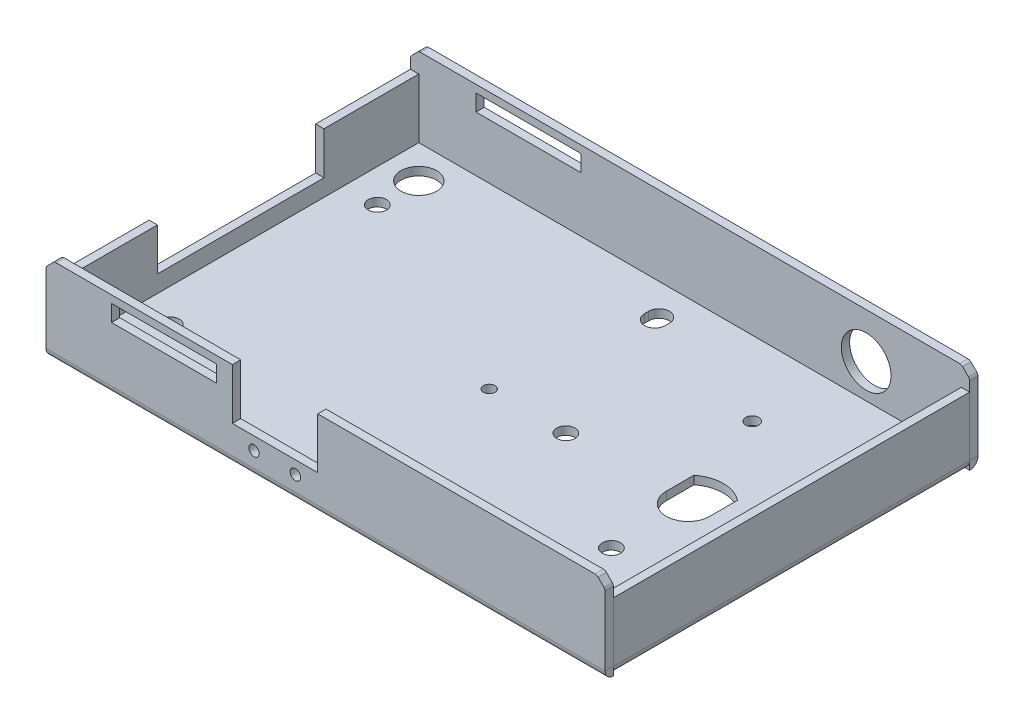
ISO-10303-21;
HEADER;
FILE_DESCRIPTION(('STEP AP214'),'2;1');
FILE_NAME('part.step','',(''),(''),'','','');
FILE_SCHEMA(('AUTOMOTIVE_DESIGN { 1 0 10303 214 1 1 1 1 }'));
ENDSEC;
DATA;
#1=APPLICATION_CONTEXT('core data for automotive mechanical design processes');
#2=APPLICATION_PROTOCOL_DEFINITION('international standard','automotive_design',2000,#1);
#3=PRODUCT_CONTEXT('',#1,'mechanical');
#4=PRODUCT('Part','Part','',(#3));
#5=PRODUCT_RELATED_PRODUCT_CATEGORY('part','',(#4));
#6=PRODUCT_DEFINITION_FORMATION('','',#4);
#7=PRODUCT_DEFINITION_CONTEXT('part definition',#1,'design');
#8=PRODUCT_DEFINITION('design','',#6,#7);
#9=PRODUCT_DEFINITION_SHAPE('','',#8);
#10=(LENGTH_UNIT() NAMED_UNIT(*) SI_UNIT(.MILLI.,.METRE.));
#11=(NAMED_UNIT(*) PLANE_ANGLE_UNIT() SI_UNIT($,.RADIAN.));
#12=(NAMED_UNIT(*) SI_UNIT($,.STERADIAN.) SOLID_ANGLE_UNIT());
#13=UNCERTAINTY_MEASURE_WITH_UNIT(LENGTH_MEASURE(1.E-05),#10,'distance_accuracy_value','');
#14=(GEOMETRIC_REPRESENTATION_CONTEXT(3) GLOBAL_UNCERTAINTY_ASSIGNED_CONTEXT((#13)) GLOBAL_UNIT_ASSIGNED_CONTEXT((#10,
#11,#12)) REPRESENTATION_CONTEXT('',''));
#15=CARTESIAN_POINT('',(0.,0.,0.));
#16=DIRECTION('',(0.,0.,1.));
#17=DIRECTION('',(1.,0.,0.));
#18=AXIS2_PLACEMENT_3D('',#15,#16,#17);
#19=CARTESIAN_POINT('',(114.338554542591,2.00000000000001,42.99));
#20=DIRECTION('',(0.,0.,1.));
#21=DIRECTION('',(0.,-1.,0.));
#22=AXIS2_PLACEMENT_3D('',#19,#20,#21);
#23=PLANE('',#22);
#24=DIRECTION('',(-1.,0.,0.));
#25=VECTOR('',#24,1.);
#26=CARTESIAN_POINT('',(114.338554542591,16.35,42.99));
#27=LINE('',#26,#25);
#28=CARTESIAN_POINT('',(-60.,16.35,42.99));
#29=VERTEX_POINT('',#28);
#30=CARTESIAN_POINT('',(-62.,16.35,42.99));
#31=VERTEX_POINT('',#30);
#32=EDGE_CURVE('E466',#29,#31,#27,.T.);
#33=ORIENTED_EDGE('',*,*,#32,.T.);
#34=DIRECTION('',(0.,1.,0.));
#35=VECTOR('',#34,1.);
#36=CARTESIAN_POINT('',(-62.,2.,42.99));
#37=LINE('',#36,#35);
#38=CARTESIAN_POINT('',(-62.,2.00000000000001,42.99));
#39=VERTEX_POINT('',#38);
#40=EDGE_CURVE('E461',#39,#31,#37,.T.);
#41=ORIENTED_EDGE('',*,*,#40,.F.);
#42=DIRECTION('',(-1.,0.,0.));
#43=VECTOR('',#42,1.);
#44=CARTESIAN_POINT('',(-60.,2.,42.99));
#45=LINE('',#44,#43);
#46=CARTESIAN_POINT('',(-60.,2.,42.99));
#47=VERTEX_POINT('',#46);
#48=EDGE_CURVE('E463',#47,#39,#45,.T.);
#49=ORIENTED_EDGE('',*,*,#48,.F.);
#50=DIRECTION('',(0.,1.,0.));
#51=VECTOR('',#50,1.);
#52=CARTESIAN_POINT('',(-60.,2.,42.99));
#53=LINE('',#52,#51);
#54=EDGE_CURVE('E1037',#47,#29,#53,.T.);
#55=ORIENTED_EDGE('',*,*,#54,.T.);
#56=EDGE_LOOP('',(#33,#41,#49,#55));
#57=FACE_BOUND('',#56,.T.);
#58=ADVANCED_FACE('F97',(#57),#23,.T.);
#59=CARTESIAN_POINT('',(114.338554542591,2.00000000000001,-42.99));
#60=DIRECTION('',(0.,0.,1.));
#61=DIRECTION('',(0.,-1.,0.));
#62=AXIS2_PLACEMENT_3D('',#59,#60,#61);
#63=PLANE('',#62);
#64=DIRECTION('',(0.,1.,0.));
#65=VECTOR('',#64,1.);
#66=CARTESIAN_POINT('',(-60.,2.,-42.99));
#67=LINE('',#66,#65);
#68=CARTESIAN_POINT('',(-60.,2.00000000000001,-42.99));
#69=VERTEX_POINT('',#68);
#70=CARTESIAN_POINT('',(-60.,16.35,-42.99));
#71=VERTEX_POINT('',#70);
#72=EDGE_CURVE('E477',#69,#71,#67,.T.);
#73=ORIENTED_EDGE('',*,*,#72,.F.);
#74=DIRECTION('',(-1.,0.,0.));
#75=VECTOR('',#74,1.);
#76=CARTESIAN_POINT('',(-60.,2.,-42.99));
#77=LINE('',#76,#75);
#78=CARTESIAN_POINT('',(-62.,2.00000000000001,-42.99));
#79=VERTEX_POINT('',#78);
#80=EDGE_CURVE('E491',#69,#79,#77,.T.);
#81=ORIENTED_EDGE('',*,*,#80,.T.);
#82=DIRECTION('',(0.,1.,0.));
#83=VECTOR('',#82,1.);
#84=CARTESIAN_POINT('',(-62.,2.,-42.99));
#85=LINE('',#84,#83);
#86=CARTESIAN_POINT('',(-62.,16.35,-42.99));
#87=VERTEX_POINT('',#86);
#88=EDGE_CURVE('E112',#79,#87,#85,.T.);
#89=ORIENTED_EDGE('',*,*,#88,.T.);
#90=DIRECTION('',(-1.,0.,0.));
#91=VECTOR('',#90,1.);
#92=CARTESIAN_POINT('',(114.338554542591,16.35,-42.99));
#93=LINE('',#92,#91);
#94=EDGE_CURVE('E13',#71,#87,#93,.T.);
#95=ORIENTED_EDGE('',*,*,#94,.F.);
#96=EDGE_LOOP('',(#73,#81,#89,#95));
#97=FACE_BOUND('',#96,.T.);
#98=ADVANCED_FACE('F99',(#97),#63,.F.);
#99=CARTESIAN_POINT('',(114.338554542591,16.35,-43.));
#100=DIRECTION('',(0.,-1.,0.));
#101=DIRECTION('',(0.,0.,-1.));
#102=AXIS2_PLACEMENT_3D('',#99,#100,#101);
#103=PLANE('',#102);
#104=ORIENTED_EDGE('',*,*,#94,.T.);
#105=DIRECTION('',(0.,0.,1.));
#106=VECTOR('',#105,1.);
#107=CARTESIAN_POINT('',(-62.,16.35,-43.));
#108=LINE('',#107,#106);
#109=CARTESIAN_POINT('',(-62.,16.35,-20.1));
#110=VERTEX_POINT('',#109);
#111=EDGE_CURVE('E478',#87,#110,#108,.T.);
#112=ORIENTED_EDGE('',*,*,#111,.T.);
#113=DIRECTION('',(-1.,0.,0.));
#114=VECTOR('',#113,1.);
#115=CARTESIAN_POINT('',(114.338554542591,16.35,-20.1));
#116=LINE('',#115,#114);
#117=CARTESIAN_POINT('',(-60.,16.35,-20.1));
#118=VERTEX_POINT('',#117);
#119=EDGE_CURVE('E105',#118,#110,#116,.T.);
#120=ORIENTED_EDGE('',*,*,#119,.F.);
#121=DIRECTION('',(0.,0.,1.));
#122=VECTOR('',#121,1.);
#123=CARTESIAN_POINT('',(-60.,16.35,-43.));
#124=LINE('',#123,#122);
#125=EDGE_CURVE('E1027',#71,#118,#124,.T.);
#126=ORIENTED_EDGE('',*,*,#125,.F.);
#127=EDGE_LOOP('',(#104,#112,#120,#126));
#128=FACE_BOUND('',#127,.T.);
#129=ADVANCED_FACE('F1070',(#128),#103,.F.);
#130=CARTESIAN_POINT('',(114.338554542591,16.35,-20.1));
#131=DIRECTION('',(0.,0.,1.));
#132=DIRECTION('',(0.,-1.,0.));
#133=AXIS2_PLACEMENT_3D('',#130,#131,#132);
#134=PLANE('',#133);
#135=DIRECTION('',(0.,-1.,0.));
#136=VECTOR('',#135,1.);
#137=CARTESIAN_POINT('',(-62.,16.35,-20.1));
#138=LINE('',#137,#136);
#139=CARTESIAN_POINT('',(-62.,6.09999999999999,-20.1));
#140=VERTEX_POINT('',#139);
#141=EDGE_CURVE('E1024',#110,#140,#138,.T.);
#142=ORIENTED_EDGE('',*,*,#141,.T.);
#143=DIRECTION('',(-1.,0.,0.));
#144=VECTOR('',#143,1.);
#145=CARTESIAN_POINT('',(114.338554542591,6.09999999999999,-20.1));
#146=LINE('',#145,#144);
#147=CARTESIAN_POINT('',(-60.,6.09999999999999,-20.1));
#148=VERTEX_POINT('',#147);
#149=EDGE_CURVE('E1046',#148,#140,#146,.T.);
#150=ORIENTED_EDGE('',*,*,#149,.F.);
#151=DIRECTION('',(0.,1.,0.));
#152=VECTOR('',#151,1.);
#153=CARTESIAN_POINT('',(-60.,16.35,-20.1));
#154=LINE('',#153,#152);
#155=EDGE_CURVE('E1030',#148,#118,#154,.T.);
#156=ORIENTED_EDGE('',*,*,#155,.T.);
#157=ORIENTED_EDGE('',*,*,#119,.T.);
#158=EDGE_LOOP('',(#142,#150,#156,#157));
#159=FACE_BOUND('',#158,.T.);
#160=ADVANCED_FACE('F1052',(#159),#134,.T.);
#161=CARTESIAN_POINT('',(114.338554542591,6.09999999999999,-20.1));
#162=DIRECTION('',(0.,1.,0.));
#163=DIRECTION('',(0.,0.,1.));
#164=AXIS2_PLACEMENT_3D('',#161,#162,#163);
#165=PLANE('',#164);
#166=DIRECTION('',(0.,0.,1.));
#167=VECTOR('',#166,1.);
#168=CARTESIAN_POINT('',(-62.,6.09999999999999,-20.1));
#169=LINE('',#168,#167);
#170=CARTESIAN_POINT('',(-62.,6.10000000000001,20.1));
#171=VERTEX_POINT('',#170);
#172=EDGE_CURVE('E1022',#140,#171,#169,.T.);
#173=ORIENTED_EDGE('',*,*,#172,.T.);
#174=DIRECTION('',(-1.,0.,0.));
#175=VECTOR('',#174,1.);
#176=CARTESIAN_POINT('',(114.338554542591,6.10000000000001,20.1));
#177=LINE('',#176,#175);
#178=CARTESIAN_POINT('',(-60.,6.10000000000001,20.1));
#179=VERTEX_POINT('',#178);
#180=EDGE_CURVE('E1043',#179,#171,#177,.T.);
#181=ORIENTED_EDGE('',*,*,#180,.F.);
#182=DIRECTION('',(0.,0.,-1.));
#183=VECTOR('',#182,1.);
#184=CARTESIAN_POINT('',(-60.,6.09999999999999,-20.1));
#185=LINE('',#184,#183);
#186=EDGE_CURVE('E1033',#179,#148,#185,.T.);
#187=ORIENTED_EDGE('',*,*,#186,.T.);
#188=ORIENTED_EDGE('',*,*,#149,.T.);
#189=EDGE_LOOP('',(#173,#181,#187,#188));
#190=FACE_BOUND('',#189,.T.);
#191=ADVANCED_FACE('F1061',(#190),#165,.T.);
#192=CARTESIAN_POINT('',(114.338554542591,6.10000000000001,20.1));
#193=DIRECTION('',(0.,0.,-1.));
#194=DIRECTION('',(0.,1.,0.));
#195=AXIS2_PLACEMENT_3D('',#192,#193,#194);
#196=PLANE('',#195);
#197=DIRECTION('',(0.,1.,0.));
#198=VECTOR('',#197,1.);
#199=CARTESIAN_POINT('',(-62.,6.10000000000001,20.1));
#200=LINE('',#199,#198);
#201=CARTESIAN_POINT('',(-62.,16.35,20.1));
#202=VERTEX_POINT('',#201);
#203=EDGE_CURVE('E1020',#171,#202,#200,.T.);
#204=ORIENTED_EDGE('',*,*,#203,.T.);
#205=DIRECTION('',(-1.,0.,0.));
#206=VECTOR('',#205,1.);
#207=CARTESIAN_POINT('',(114.338554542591,16.35,20.1));
#208=LINE('',#207,#206);
#209=CARTESIAN_POINT('',(-60.,16.35,20.1));
#210=VERTEX_POINT('',#209);
#211=EDGE_CURVE('E1040',#210,#202,#208,.T.);
#212=ORIENTED_EDGE('',*,*,#211,.F.);
#213=DIRECTION('',(0.,-1.,0.));
#214=VECTOR('',#213,1.);
#215=CARTESIAN_POINT('',(-60.,6.10000000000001,20.1));
#216=LINE('',#215,#214);
#217=EDGE_CURVE('E1035',#210,#179,#216,.T.);
#218=ORIENTED_EDGE('',*,*,#217,.T.);
#219=ORIENTED_EDGE('',*,*,#180,.T.);
#220=EDGE_LOOP('',(#204,#212,#218,#219));
#221=FACE_BOUND('',#220,.T.);
#222=ADVANCED_FACE('F1064',(#221),#196,.T.);
#223=ORIENTED_EDGE('',*,*,#211,.T.);
#224=EDGE_CURVE('E469',#202,#31,#108,.T.);
#225=ORIENTED_EDGE('',*,*,#224,.T.);
#226=ORIENTED_EDGE('',*,*,#32,.F.);
#227=EDGE_CURVE('E1031',#210,#29,#124,.T.);
#228=ORIENTED_EDGE('',*,*,#227,.F.);
#229=EDGE_LOOP('',(#223,#225,#226,#228));
#230=FACE_BOUND('',#229,.T.);
#231=ADVANCED_FACE('F1245',(#230),#103,.F.);
#232=CARTESIAN_POINT('',(-60.,2.,-43.));
#233=DIRECTION('',(-1.,0.,0.));
#234=DIRECTION('',(0.,0.,1.));
#235=AXIS2_PLACEMENT_3D('',#232,#233,#234);
#236=PLANE('',#235);
#237=DIRECTION('',(0.,0.,1.));
#238=VECTOR('',#237,1.);
#239=CARTESIAN_POINT('',(-60.,2.,-42.99));
#240=LINE('',#239,#238);
#241=EDGE_CURVE('E490',#69,#47,#240,.T.);
#242=ORIENTED_EDGE('',*,*,#241,.F.);
#243=ORIENTED_EDGE('',*,*,#72,.T.);
#244=ORIENTED_EDGE('',*,*,#125,.T.);
#245=ORIENTED_EDGE('',*,*,#155,.F.);
#246=ORIENTED_EDGE('',*,*,#186,.F.);
#247=ORIENTED_EDGE('',*,*,#217,.F.);
#248=ORIENTED_EDGE('',*,*,#227,.T.);
#249=ORIENTED_EDGE('',*,*,#54,.F.);
#250=EDGE_LOOP('',(#242,#243,#244,#245,#246,#247,#248,#249));
#251=FACE_BOUND('',#250,.T.);
#252=ADVANCED_FACE('F1069',(#251),#236,.F.);
#253=CARTESIAN_POINT('',(-62.,21.1,-45.));
#254=DIRECTION('',(1.,0.,0.));
#255=DIRECTION('',(0.,0.,-1.));
#256=AXIS2_PLACEMENT_3D('',#253,#254,#255);
#257=PLANE('',#256);
#258=ORIENTED_EDGE('',*,*,#88,.F.);
#259=DIRECTION('',(0.,0.,1.));
#260=VECTOR('',#259,1.);
#261=CARTESIAN_POINT('',(-62.,2.00000000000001,-43.));
#262=LINE('',#261,#260);
#263=EDGE_CURVE('E472',#79,#39,#262,.T.);
#264=ORIENTED_EDGE('',*,*,#263,.T.);
#265=ORIENTED_EDGE('',*,*,#40,.T.);
#266=ORIENTED_EDGE('',*,*,#224,.F.);
#267=ORIENTED_EDGE('',*,*,#203,.F.);
#268=ORIENTED_EDGE('',*,*,#172,.F.);
#269=ORIENTED_EDGE('',*,*,#141,.F.);
#270=ORIENTED_EDGE('',*,*,#111,.F.);
#271=EDGE_LOOP('',(#258,#264,#265,#266,#267,#268,#269,#270));
#272=FACE_BOUND('',#271,.T.);
#273=ADVANCED_FACE('F473',(#272),#257,.F.);
#274=CARTESIAN_POINT('',(-60.,2.,42.99));
#275=DIRECTION('',(0.,0.,1.));
#276=DIRECTION('',(0.,-1.,0.));
#277=AXIS2_PLACEMENT_3D('',#274,#275,#276);
#278=PLANE('',#277);
#279=CARTESIAN_POINT('',(-60.,2.,42.99));
#280=DIRECTION('',(0.,0.,1.));
#281=DIRECTION('',(1.,0.,0.));
#282=AXIS2_PLACEMENT_3D('',#279,#280,#281);
#283=CIRCLE('',#282,2.);
#284=CARTESIAN_POINT('',(-60.,0.,42.99));
#285=VERTEX_POINT('',#284);
#286=EDGE_CURVE('E507',#285,#39,#283,.F.);
#287=ORIENTED_EDGE('',*,*,#286,.F.);
#288=DIRECTION('',(-1.,0.,0.));
#289=VECTOR('',#288,1.);
#290=CARTESIAN_POINT('',(-61.15,0.,42.99));
#291=LINE('',#290,#289);
#292=CARTESIAN_POINT('',(-62.,0.,42.99));
#293=VERTEX_POINT('',#292);
#294=EDGE_CURVE('E509',#285,#293,#291,.T.);
#295=ORIENTED_EDGE('',*,*,#294,.T.);
#296=DIRECTION('',(0.,-1.,0.));
#297=VECTOR('',#296,1.);
#298=CARTESIAN_POINT('',(-62.,2.,42.99));
#299=LINE('',#298,#297);
#300=EDGE_CURVE('E500',#39,#293,#299,.T.);
#301=ORIENTED_EDGE('',*,*,#300,.F.);
#302=EDGE_LOOP('',(#287,#295,#301));
#303=FACE_BOUND('',#302,.T.);
#304=ADVANCED_FACE('F506',(#303),#278,.F.);
#305=CARTESIAN_POINT('',(-1.80000000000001,5.7,45.));
#306=DIRECTION('',(0.,0.,1.));
#307=DIRECTION('',(1.,0.,0.));
#308=AXIS2_PLACEMENT_3D('',#305,#306,#307);
#309=CYLINDRICAL_SURFACE('',#308,1.24999999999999);
#310=CARTESIAN_POINT('',(-1.80000000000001,5.7,43.));
#311=DIRECTION('',(0.,0.,1.));
#312=DIRECTION('',(1.,0.,0.));
#313=AXIS2_PLACEMENT_3D('',#310,#311,#312);
#314=CIRCLE('',#313,1.24999999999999);
#315=CARTESIAN_POINT('',(-0.550000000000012,5.7,43.));
#316=VERTEX_POINT('',#315);
#317=EDGE_CURVE('E894',#316,#316,#314,.T.);
#318=ORIENTED_EDGE('',*,*,#317,.F.);
#319=EDGE_LOOP('',(#318));
#320=FACE_BOUND('',#319,.T.);
#321=CARTESIAN_POINT('',(-1.80000000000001,5.7,45.));
#322=DIRECTION('',(0.,0.,1.));
#323=DIRECTION('',(1.,0.,0.));
#324=AXIS2_PLACEMENT_3D('',#321,#322,#323);
#325=CIRCLE('',#324,1.24999999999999);
#326=CARTESIAN_POINT('',(-0.550000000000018,5.7,45.));
#327=VERTEX_POINT('',#326);
#328=EDGE_CURVE('E1009',#327,#327,#325,.T.);
#329=ORIENTED_EDGE('',*,*,#328,.T.);
#330=EDGE_LOOP('',(#329));
#331=FACE_BOUND('',#330,.T.);
#332=ADVANCED_FACE('F1308',(#320,#331),#309,.F.);
#333=CARTESIAN_POINT('',(-60.0000000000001,21.1,-229.688906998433));
#334=DIRECTION('',(0.707106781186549,-0.707106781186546,0.));
#335=DIRECTION('',(-0.707106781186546,-0.707106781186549,0.));
#336=AXIS2_PLACEMENT_3D('',#333,#334,#335);
#337=PLANE('',#336);
#338=DIRECTION('',(0.,0.,1.));
#339=VECTOR('',#338,1.);
#340=CARTESIAN_POINT('',(-61.7071067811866,19.3928932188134,-229.688906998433));
#341=LINE('',#340,#339);
#342=CARTESIAN_POINT('',(-61.7071067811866,19.3928932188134,43.));
#343=VERTEX_POINT('',#342);
#344=CARTESIAN_POINT('',(-61.7071067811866,19.3928932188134,45.));
#345=VERTEX_POINT('',#344);
#346=EDGE_CURVE('E1006',#343,#345,#341,.T.);
#347=ORIENTED_EDGE('',*,*,#346,.T.);
#348=DIRECTION('',(-0.707106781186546,-0.707106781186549,0.));
#349=VECTOR('',#348,1.);
#350=CARTESIAN_POINT('',(-60.,21.1,45.));
#351=LINE('',#350,#349);
#352=CARTESIAN_POINT('',(-60.2928932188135,20.8071067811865,45.));
#353=VERTEX_POINT('',#352);
#354=EDGE_CURVE('E911',#353,#345,#351,.T.);
#355=ORIENTED_EDGE('',*,*,#354,.F.);
#356=DIRECTION('',(0.,0.,1.));
#357=VECTOR('',#356,1.);
#358=CARTESIAN_POINT('',(-60.2928932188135,20.8071067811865,-229.688906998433));
#359=LINE('',#358,#357);
#360=CARTESIAN_POINT('',(-60.2928932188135,20.8071067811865,43.));
#361=VERTEX_POINT('',#360);
#362=EDGE_CURVE('E1003',#361,#353,#359,.T.);
#363=ORIENTED_EDGE('',*,*,#362,.F.);
#364=DIRECTION('',(0.707106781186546,0.707106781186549,0.));
#365=VECTOR('',#364,1.);
#366=CARTESIAN_POINT('',(-60.,21.1,43.));
#367=LINE('',#366,#365);
#368=EDGE_CURVE('E876',#343,#361,#367,.T.);
#369=ORIENTED_EDGE('',*,*,#368,.F.);
#370=EDGE_LOOP('',(#347,#355,#363,#369));
#371=FACE_BOUND('',#370,.T.);
#372=ADVANCED_FACE('F1141',(#371),#337,.F.);
#373=CARTESIAN_POINT('',(-59.585786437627,20.1,-229.688906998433));
#374=DIRECTION('',(0.,0.,1.));
#375=DIRECTION('',(0.,-1.,0.));
#376=AXIS2_PLACEMENT_3D('',#373,#374,#375);
#377=CYLINDRICAL_SURFACE('',#376,1.);
#378=ORIENTED_EDGE('',*,*,#362,.T.);
#379=CARTESIAN_POINT('',(-59.5857864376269,20.1,45.));
#380=DIRECTION('',(0.,0.,-1.));
#381=DIRECTION('',(-1.,0.,0.));
#382=AXIS2_PLACEMENT_3D('',#379,#380,#381);
#383=CIRCLE('',#382,1.);
#384=CARTESIAN_POINT('',(-59.5857864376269,21.1,45.));
#385=VERTEX_POINT('',#384);
#386=EDGE_CURVE('E914',#385,#353,#383,.F.);
#387=ORIENTED_EDGE('',*,*,#386,.F.);
#388=DIRECTION('',(0.,0.,1.));
#389=VECTOR('',#388,1.);
#390=CARTESIAN_POINT('',(-59.585786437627,21.1,-229.688906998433));
#391=LINE('',#390,#389);
#392=CARTESIAN_POINT('',(-59.5857864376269,21.1,43.));
#393=VERTEX_POINT('',#392);
#394=EDGE_CURVE('E1000',#393,#385,#391,.T.);
#395=ORIENTED_EDGE('',*,*,#394,.F.);
#396=CARTESIAN_POINT('',(-59.5857864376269,20.1,43.));
#397=DIRECTION('',(0.,0.,1.));
#398=DIRECTION('',(1.,0.,0.));
#399=AXIS2_PLACEMENT_3D('',#396,#397,#398);
#400=CIRCLE('',#399,1.);
#401=EDGE_CURVE('E873',#361,#393,#400,.F.);
#402=ORIENTED_EDGE('',*,*,#401,.F.);
#403=EDGE_LOOP('',(#378,#387,#395,#402));
#404=FACE_BOUND('',#403,.T.);
#405=ADVANCED_FACE('F1137',(#404),#377,.T.);
#406=CARTESIAN_POINT('',(-60.0000000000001,21.1,-229.688906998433));
#407=DIRECTION('',(0.,-1.,0.));
#408=DIRECTION('',(-1.,0.,0.));
#409=AXIS2_PLACEMENT_3D('',#406,#407,#408);
#410=PLANE('',#409);
#411=ORIENTED_EDGE('',*,*,#394,.T.);
#412=DIRECTION('',(1.,0.,0.));
#413=VECTOR('',#412,1.);
#414=CARTESIAN_POINT('',(-62.,21.1,45.));
#415=LINE('',#414,#413);
#416=CARTESIAN_POINT('',(-17.,21.1,45.));
#417=VERTEX_POINT('',#416);
#418=EDGE_CURVE('E976',#385,#417,#415,.T.);
#419=ORIENTED_EDGE('',*,*,#418,.T.);
#420=DIRECTION('',(0.,0.,1.));
#421=VECTOR('',#420,1.);
#422=CARTESIAN_POINT('',(-17.,21.1,-229.688906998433));
#423=LINE('',#422,#421);
#424=CARTESIAN_POINT('',(-17.,21.1,43.));
#425=VERTEX_POINT('',#424);
#426=EDGE_CURVE('E993',#425,#417,#423,.T.);
#427=ORIENTED_EDGE('',*,*,#426,.F.);
#428=DIRECTION('',(1.,0.,0.));
#429=VECTOR('',#428,1.);
#430=CARTESIAN_POINT('',(-60.,21.1,43.));
#431=LINE('',#430,#429);
#432=EDGE_CURVE('E870',#393,#425,#431,.T.);
#433=ORIENTED_EDGE('',*,*,#432,.F.);
#434=EDGE_LOOP('',(#411,#419,#427,#433));
#435=FACE_BOUND('',#434,.T.);
#436=ADVANCED_FACE('F1134',(#435),#410,.F.);
#437=CARTESIAN_POINT('',(-17.,21.1,-229.688906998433));
#438=DIRECTION('',(1.,0.,0.));
#439=DIRECTION('',(0.,-1.,0.));
#440=AXIS2_PLACEMENT_3D('',#437,#438,#439);
#441=PLANE('',#440);
#442=DIRECTION('',(0.,-1.,0.));
#443=VECTOR('',#442,1.);
#444=CARTESIAN_POINT('',(-17.,21.1,45.));
#445=LINE('',#444,#443);
#446=CARTESIAN_POINT('',(-17.,8.8,45.));
#447=VERTEX_POINT('',#446);
#448=EDGE_CURVE('E998',#417,#447,#445,.T.);
#449=ORIENTED_EDGE('',*,*,#448,.T.);
#450=DIRECTION('',(0.,0.,1.));
#451=VECTOR('',#450,1.);
#452=CARTESIAN_POINT('',(-17.,8.8,-229.688906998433));
#453=LINE('',#452,#451);
#454=CARTESIAN_POINT('',(-17.,8.8,43.));
#455=VERTEX_POINT('',#454);
#456=EDGE_CURVE('E986',#455,#447,#453,.T.);
#457=ORIENTED_EDGE('',*,*,#456,.F.);
#458=DIRECTION('',(0.,1.,0.));
#459=VECTOR('',#458,1.);
#460=CARTESIAN_POINT('',(-17.,21.1,43.));
#461=LINE('',#460,#459);
#462=EDGE_CURVE('E996',#455,#425,#461,.T.);
#463=ORIENTED_EDGE('',*,*,#462,.T.);
#464=ORIENTED_EDGE('',*,*,#426,.T.);
#465=EDGE_LOOP('',(#449,#457,#463,#464));
#466=FACE_BOUND('',#465,.T.);
#467=ADVANCED_FACE('F1129',(#466),#441,.T.);
#468=CARTESIAN_POINT('',(-17.,8.8,-229.688906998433));
#469=DIRECTION('',(0.,1.,0.));
#470=DIRECTION('',(1.,0.,0.));
#471=AXIS2_PLACEMENT_3D('',#468,#469,#470);
#472=PLANE('',#471);
#473=DIRECTION('',(1.,0.,0.));
#474=VECTOR('',#473,1.);
#475=CARTESIAN_POINT('',(-17.,8.8,45.));
#476=LINE('',#475,#474);
#477=CARTESIAN_POINT('',(3.6,8.79999999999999,45.));
#478=VERTEX_POINT('',#477);
#479=EDGE_CURVE('E991',#447,#478,#476,.T.);
#480=ORIENTED_EDGE('',*,*,#479,.T.);
#481=DIRECTION('',(0.,0.,1.));
#482=VECTOR('',#481,1.);
#483=CARTESIAN_POINT('',(3.59999999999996,8.79999999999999,-229.688906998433));
#484=LINE('',#483,#482);
#485=CARTESIAN_POINT('',(3.6,8.79999999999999,43.));
#486=VERTEX_POINT('',#485);
#487=EDGE_CURVE('E979',#486,#478,#484,.T.);
#488=ORIENTED_EDGE('',*,*,#487,.F.);
#489=DIRECTION('',(-1.,0.,0.));
#490=VECTOR('',#489,1.);
#491=CARTESIAN_POINT('',(-17.,8.8,43.));
#492=LINE('',#491,#490);
#493=EDGE_CURVE('E989',#486,#455,#492,.T.);
#494=ORIENTED_EDGE('',*,*,#493,.T.);
#495=ORIENTED_EDGE('',*,*,#456,.T.);
#496=EDGE_LOOP('',(#480,#488,#494,#495));
#497=FACE_BOUND('',#496,.T.);
#498=ADVANCED_FACE('F1127',(#497),#472,.T.);
#499=CARTESIAN_POINT('',(3.59999999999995,8.79999999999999,-229.688906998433));
#500=DIRECTION('',(-1.,0.,0.));
#501=DIRECTION('',(0.,1.,0.));
#502=AXIS2_PLACEMENT_3D('',#499,#500,#501);
#503=PLANE('',#502);
#504=DIRECTION('',(0.,1.,0.));
#505=VECTOR('',#504,1.);
#506=CARTESIAN_POINT('',(3.6,8.8,45.));
#507=LINE('',#506,#505);
#508=CARTESIAN_POINT('',(3.6,21.1,45.));
#509=VERTEX_POINT('',#508);
#510=EDGE_CURVE('E984',#478,#509,#507,.T.);
#511=ORIENTED_EDGE('',*,*,#510,.T.);
#512=DIRECTION('',(0.,0.,1.));
#513=VECTOR('',#512,1.);
#514=CARTESIAN_POINT('',(3.59999999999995,21.1,-229.688906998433));
#515=LINE('',#514,#513);
#516=CARTESIAN_POINT('',(3.6,21.1,43.));
#517=VERTEX_POINT('',#516);
#518=EDGE_CURVE('E975',#517,#509,#515,.T.);
#519=ORIENTED_EDGE('',*,*,#518,.F.);
#520=DIRECTION('',(0.,-1.,0.));
#521=VECTOR('',#520,1.);
#522=CARTESIAN_POINT('',(3.6,8.8,43.));
#523=LINE('',#522,#521);
#524=EDGE_CURVE('E982',#517,#486,#523,.T.);
#525=ORIENTED_EDGE('',*,*,#524,.T.);
#526=ORIENTED_EDGE('',*,*,#487,.T.);
#527=EDGE_LOOP('',(#511,#519,#525,#526));
#528=FACE_BOUND('',#527,.T.);
#529=ADVANCED_FACE('F1121',(#528),#503,.T.);
#530=ORIENTED_EDGE('',*,*,#518,.T.);
#531=CARTESIAN_POINT('',(70.5857864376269,21.1,45.));
#532=VERTEX_POINT('',#531);
#533=EDGE_CURVE('E973',#509,#532,#415,.T.);
#534=ORIENTED_EDGE('',*,*,#533,.T.);
#535=DIRECTION('',(0.,0.,1.));
#536=VECTOR('',#535,1.);
#537=CARTESIAN_POINT('',(70.5857864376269,21.1,-229.688906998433));
#538=LINE('',#537,#536);
#539=CARTESIAN_POINT('',(70.5857864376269,21.1,43.));
#540=VERTEX_POINT('',#539);
#541=EDGE_CURVE('E970',#540,#532,#538,.T.);
#542=ORIENTED_EDGE('',*,*,#541,.F.);
#543=EDGE_CURVE('E869',#517,#540,#431,.T.);
#544=ORIENTED_EDGE('',*,*,#543,.F.);
#545=EDGE_LOOP('',(#530,#534,#542,#544));
#546=FACE_BOUND('',#545,.T.);
#547=ADVANCED_FACE('F1117',(#546),#410,.F.);
#548=CARTESIAN_POINT('',(70.5857864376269,20.1,-229.688906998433));
#549=DIRECTION('',(0.,0.,1.));
#550=DIRECTION('',(0.,-1.,0.));
#551=AXIS2_PLACEMENT_3D('',#548,#549,#550);
#552=CYLINDRICAL_SURFACE('',#551,1.);
#553=ORIENTED_EDGE('',*,*,#541,.T.);
#554=CARTESIAN_POINT('',(70.5857864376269,20.1,45.));
#555=DIRECTION('',(0.,0.,-1.));
#556=DIRECTION('',(-1.,0.,0.));
#557=AXIS2_PLACEMENT_3D('',#554,#555,#556);
#558=CIRCLE('',#557,1.);
#559=CARTESIAN_POINT('',(71.2928932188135,20.8071067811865,45.));
#560=VERTEX_POINT('',#559);
#561=EDGE_CURVE('E917',#560,#532,#558,.F.);
#562=ORIENTED_EDGE('',*,*,#561,.F.);
#563=DIRECTION('',(0.,0.,1.));
#564=VECTOR('',#563,1.);
#565=CARTESIAN_POINT('',(71.2928932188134,20.8071067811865,-229.688906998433));
#566=LINE('',#565,#564);
#567=CARTESIAN_POINT('',(71.2928932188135,20.8071067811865,43.));
#568=VERTEX_POINT('',#567);
#569=EDGE_CURVE('E967',#568,#560,#566,.T.);
#570=ORIENTED_EDGE('',*,*,#569,.F.);
#571=CARTESIAN_POINT('',(70.5857864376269,20.1,43.));
#572=DIRECTION('',(0.,0.,1.));
#573=DIRECTION('',(1.,0.,0.));
#574=AXIS2_PLACEMENT_3D('',#571,#572,#573);
#575=CIRCLE('',#574,1.);
#576=EDGE_CURVE('E866',#540,#568,#575,.F.);
#577=ORIENTED_EDGE('',*,*,#576,.F.);
#578=EDGE_LOOP('',(#553,#562,#570,#577));
#579=FACE_BOUND('',#578,.T.);
#580=ADVANCED_FACE('F1111',(#579),#552,.T.);
#581=CARTESIAN_POINT('',(71.,21.1,-229.688906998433));
#582=DIRECTION('',(-0.707106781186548,-0.707106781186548,0.));
#583=DIRECTION('',(-0.707106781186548,0.707106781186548,0.));
#584=AXIS2_PLACEMENT_3D('',#581,#582,#583);
#585=PLANE('',#584);
#586=ORIENTED_EDGE('',*,*,#569,.T.);
#587=DIRECTION('',(-0.707106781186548,0.707106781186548,0.));
#588=VECTOR('',#587,1.);
#589=CARTESIAN_POINT('',(71.,21.1,45.));
#590=LINE('',#589,#588);
#591=CARTESIAN_POINT('',(72.7071067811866,19.3928932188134,45.));
#592=VERTEX_POINT('',#591);
#593=EDGE_CURVE('E920',#592,#560,#590,.T.);
#594=ORIENTED_EDGE('',*,*,#593,.F.);
#595=DIRECTION('',(0.,0.,1.));
#596=VECTOR('',#595,1.);
#597=CARTESIAN_POINT('',(72.7071067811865,19.3928932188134,-229.688906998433));
#598=LINE('',#597,#596);
#599=CARTESIAN_POINT('',(72.7071067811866,19.3928932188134,43.));
#600=VERTEX_POINT('',#599);
#601=EDGE_CURVE('E964',#600,#592,#598,.T.);
#602=ORIENTED_EDGE('',*,*,#601,.F.);
#603=DIRECTION('',(0.707106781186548,-0.707106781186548,0.));
#604=VECTOR('',#603,1.);
#605=CARTESIAN_POINT('',(71.,21.1,43.));
#606=LINE('',#605,#604);
#607=EDGE_CURVE('E863',#568,#600,#606,.T.);
#608=ORIENTED_EDGE('',*,*,#607,.F.);
#609=EDGE_LOOP('',(#586,#594,#602,#608));
#610=FACE_BOUND('',#609,.T.);
#611=ADVANCED_FACE('F1109',(#610),#585,.F.);
#612=CARTESIAN_POINT('',(72.,18.6857864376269,-229.688906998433));
#613=DIRECTION('',(0.,0.,1.));
#614=DIRECTION('',(0.,-1.,0.));
#615=AXIS2_PLACEMENT_3D('',#612,#613,#614);
#616=CYLINDRICAL_SURFACE('',#615,1.);
#617=ORIENTED_EDGE('',*,*,#601,.T.);
#618=CARTESIAN_POINT('',(72.,18.6857864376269,45.));
#619=DIRECTION('',(0.,0.,-1.));
#620=DIRECTION('',(-1.,0.,0.));
#621=AXIS2_PLACEMENT_3D('',#618,#619,#620);
#622=CIRCLE('',#621,1.);
#623=CARTESIAN_POINT('',(73.,18.6857864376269,45.));
#624=VERTEX_POINT('',#623);
#625=EDGE_CURVE('E923',#624,#592,#622,.F.);
#626=ORIENTED_EDGE('',*,*,#625,.F.);
#627=DIRECTION('',(0.,0.,1.));
#628=VECTOR('',#627,1.);
#629=CARTESIAN_POINT('',(73.,18.6857864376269,-229.688906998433));
#630=LINE('',#629,#628);
#631=CARTESIAN_POINT('',(73.,18.6857864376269,43.));
#632=VERTEX_POINT('',#631);
#633=EDGE_CURVE('E900',#632,#624,#630,.T.);
#634=ORIENTED_EDGE('',*,*,#633,.F.);
#635=CARTESIAN_POINT('',(72.,18.6857864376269,43.));
#636=DIRECTION('',(0.,0.,1.));
#637=DIRECTION('',(1.,0.,0.));
#638=AXIS2_PLACEMENT_3D('',#635,#636,#637);
#639=CIRCLE('',#638,1.);
#640=EDGE_CURVE('E492',#600,#632,#639,.F.);
#641=ORIENTED_EDGE('',*,*,#640,.F.);
#642=EDGE_LOOP('',(#617,#626,#634,#641));
#643=FACE_BOUND('',#642,.T.);
#644=ADVANCED_FACE('F1101',(#643),#616,.T.);
#645=CARTESIAN_POINT('',(-20.8,19.3,-45.));
#646=DIRECTION('',(1.,0.,0.));
#647=DIRECTION('',(0.,0.,-1.));
#648=AXIS2_PLACEMENT_3D('',#645,#646,#647);
#649=PLANE('',#648);
#650=DIRECTION('',(0.,0.,1.));
#651=VECTOR('',#650,1.);
#652=CARTESIAN_POINT('',(-20.8,15.3,-45.));
#653=LINE('',#652,#651);
#654=CARTESIAN_POINT('',(-20.8,15.3,43.));
#655=VERTEX_POINT('',#654);
#656=CARTESIAN_POINT('',(-20.8,15.3,45.));
#657=VERTEX_POINT('',#656);
#658=EDGE_CURVE('E961',#655,#657,#653,.T.);
#659=ORIENTED_EDGE('',*,*,#658,.T.);
#660=DIRECTION('',(0.,1.,0.));
#661=VECTOR('',#660,1.);
#662=CARTESIAN_POINT('',(-20.8,19.3,45.));
#663=LINE('',#662,#661);
#664=CARTESIAN_POINT('',(-20.8,19.3,45.));
#665=VERTEX_POINT('',#664);
#666=EDGE_CURVE('E958',#657,#665,#663,.T.);
#667=ORIENTED_EDGE('',*,*,#666,.T.);
#668=DIRECTION('',(0.,0.,1.));
#669=VECTOR('',#668,1.);
#670=CARTESIAN_POINT('',(-20.8,19.3,-45.));
#671=LINE('',#670,#669);
#672=CARTESIAN_POINT('',(-20.8,19.3,43.));
#673=VERTEX_POINT('',#672);
#674=EDGE_CURVE('E955',#673,#665,#671,.T.);
#675=ORIENTED_EDGE('',*,*,#674,.F.);
#676=DIRECTION('',(0.,1.,0.));
#677=VECTOR('',#676,1.);
#678=CARTESIAN_POINT('',(-20.8,1.99999999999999,43.));
#679=LINE('',#678,#677);
#680=EDGE_CURVE('E885',#655,#673,#679,.T.);
#681=ORIENTED_EDGE('',*,*,#680,.F.);
#682=EDGE_LOOP('',(#659,#667,#675,#681));
#683=FACE_BOUND('',#682,.T.);
#684=ADVANCED_FACE('F1375',(#683),#649,.F.);
#685=CARTESIAN_POINT('',(-46.2,19.3,-45.));
#686=DIRECTION('',(0.,1.,0.));
#687=DIRECTION('',(0.,0.,1.));
#688=AXIS2_PLACEMENT_3D('',#685,#686,#687);
#689=PLANE('',#688);
#690=ORIENTED_EDGE('',*,*,#674,.T.);
#691=DIRECTION('',(-1.,0.,0.));
#692=VECTOR('',#691,1.);
#693=CARTESIAN_POINT('',(-46.2,19.3,45.));
#694=LINE('',#693,#692);
#695=CARTESIAN_POINT('',(-46.2,19.3,45.));
#696=VERTEX_POINT('',#695);
#697=EDGE_CURVE('E952',#665,#696,#694,.T.);
#698=ORIENTED_EDGE('',*,*,#697,.T.);
#699=DIRECTION('',(0.,0.,1.));
#700=VECTOR('',#699,1.);
#701=CARTESIAN_POINT('',(-46.2,19.3,-45.));
#702=LINE('',#701,#700);
#703=CARTESIAN_POINT('',(-46.2,19.3,43.));
#704=VERTEX_POINT('',#703);
#705=EDGE_CURVE('E949',#704,#696,#702,.T.);
#706=ORIENTED_EDGE('',*,*,#705,.F.);
#707=DIRECTION('',(-1.,0.,0.));
#708=VECTOR('',#707,1.);
#709=CARTESIAN_POINT('',(-60.,19.3,43.));
#710=LINE('',#709,#708);
#711=EDGE_CURVE('E892',#673,#704,#710,.T.);
#712=ORIENTED_EDGE('',*,*,#711,.F.);
#713=EDGE_LOOP('',(#690,#698,#706,#712));
#714=FACE_BOUND('',#713,.T.);
#715=ADVANCED_FACE('F1382',(#714),#689,.F.);
#716=CARTESIAN_POINT('',(-46.2,19.3,-45.));
#717=DIRECTION('',(-1.,0.,0.));
#718=DIRECTION('',(0.,0.,1.));
#719=AXIS2_PLACEMENT_3D('',#716,#717,#718);
#720=PLANE('',#719);
#721=ORIENTED_EDGE('',*,*,#705,.T.);
#722=DIRECTION('',(0.,-1.,0.));
#723=VECTOR('',#722,1.);
#724=CARTESIAN_POINT('',(-46.2,19.3,45.));
#725=LINE('',#724,#723);
#726=CARTESIAN_POINT('',(-46.2,15.3,45.));
#727=VERTEX_POINT('',#726);
#728=EDGE_CURVE('E946',#696,#727,#725,.T.);
#729=ORIENTED_EDGE('',*,*,#728,.T.);
#730=DIRECTION('',(0.,0.,1.));
#731=VECTOR('',#730,1.);
#732=CARTESIAN_POINT('',(-46.2,15.3,-45.));
#733=LINE('',#732,#731);
#734=CARTESIAN_POINT('',(-46.2,15.3,43.));
#735=VERTEX_POINT('',#734);
#736=EDGE_CURVE('E943',#735,#727,#733,.T.);
#737=ORIENTED_EDGE('',*,*,#736,.F.);
#738=DIRECTION('',(0.,-1.,0.));
#739=VECTOR('',#738,1.);
#740=CARTESIAN_POINT('',(-46.2,1.99999999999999,43.));
#741=LINE('',#740,#739);
#742=EDGE_CURVE('E890',#704,#735,#741,.T.);
#743=ORIENTED_EDGE('',*,*,#742,.F.);
#744=EDGE_LOOP('',(#721,#729,#737,#743));
#745=FACE_BOUND('',#744,.T.);
#746=ADVANCED_FACE('F1390',(#745),#720,.F.);
#747=CARTESIAN_POINT('',(-46.2,15.3,-45.));
#748=DIRECTION('',(0.,-1.,0.));
#749=DIRECTION('',(0.,0.,-1.));
#750=AXIS2_PLACEMENT_3D('',#747,#748,#749);
#751=PLANE('',#750);
#752=ORIENTED_EDGE('',*,*,#736,.T.);
#753=DIRECTION('',(1.,0.,0.));
#754=VECTOR('',#753,1.);
#755=CARTESIAN_POINT('',(-46.2,15.3,45.));
#756=LINE('',#755,#754);
#757=EDGE_CURVE('E941',#727,#657,#756,.T.);
#758=ORIENTED_EDGE('',*,*,#757,.T.);
#759=ORIENTED_EDGE('',*,*,#658,.F.);
#760=DIRECTION('',(1.,0.,0.));
#761=VECTOR('',#760,1.);
#762=CARTESIAN_POINT('',(-60.,15.3,43.));
#763=LINE('',#762,#761);
#764=EDGE_CURVE('E888',#735,#655,#763,.T.);
#765=ORIENTED_EDGE('',*,*,#764,.F.);
#766=EDGE_LOOP('',(#752,#758,#759,#765));
#767=FACE_BOUND('',#766,.T.);
#768=ADVANCED_FACE('F1398',(#767),#751,.F.);
#769=CARTESIAN_POINT('',(-11.8,5.7,45.));
#770=DIRECTION('',(0.,0.,1.));
#771=DIRECTION('',(1.,0.,0.));
#772=AXIS2_PLACEMENT_3D('',#769,#770,#771);
#773=CYLINDRICAL_SURFACE('',#772,1.24999999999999);
#774=CARTESIAN_POINT('',(-11.8,5.7,43.));
#775=DIRECTION('',(0.,0.,1.));
#776=DIRECTION('',(1.,0.,0.));
#777=AXIS2_PLACEMENT_3D('',#774,#775,#776);
#778=CIRCLE('',#777,1.24999999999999);
#779=CARTESIAN_POINT('',(-10.55,5.7,43.));
#780=VERTEX_POINT('',#779);
#781=EDGE_CURVE('E897',#780,#780,#778,.T.);
#782=ORIENTED_EDGE('',*,*,#781,.F.);
#783=EDGE_LOOP('',(#782));
#784=FACE_BOUND('',#783,.T.);
#785=CARTESIAN_POINT('',(-11.8,5.7,45.));
#786=DIRECTION('',(0.,0.,1.));
#787=DIRECTION('',(1.,0.,0.));
#788=AXIS2_PLACEMENT_3D('',#785,#786,#787);
#789=CIRCLE('',#788,1.24999999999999);
#790=CARTESIAN_POINT('',(-10.55,5.7,45.));
#791=VERTEX_POINT('',#790);
#792=EDGE_CURVE('E938',#791,#791,#789,.T.);
#793=ORIENTED_EDGE('',*,*,#792,.T.);
#794=EDGE_LOOP('',(#793));
#795=FACE_BOUND('',#794,.T.);
#796=ADVANCED_FACE('F1406',(#784,#795),#773,.F.);
#797=CARTESIAN_POINT('',(-61.,18.6857864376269,-229.688906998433));
#798=DIRECTION('',(0.,0.,1.));
#799=DIRECTION('',(0.,-1.,0.));
#800=AXIS2_PLACEMENT_3D('',#797,#798,#799);
#801=CYLINDRICAL_SURFACE('',#800,1.);
#802=DIRECTION('',(0.,0.,1.));
#803=VECTOR('',#802,1.);
#804=CARTESIAN_POINT('',(-62.,18.6857864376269,-229.688906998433));
#805=LINE('',#804,#803);
#806=CARTESIAN_POINT('',(-62.,18.6857864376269,43.));
#807=VERTEX_POINT('',#806);
#808=CARTESIAN_POINT('',(-62.,18.6857864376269,45.));
#809=VERTEX_POINT('',#808);
#810=EDGE_CURVE('E935',#807,#809,#805,.T.);
#811=ORIENTED_EDGE('',*,*,#810,.T.);
#812=CARTESIAN_POINT('',(-61.,18.6857864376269,45.));
#813=DIRECTION('',(0.,0.,-1.));
#814=DIRECTION('',(-1.,0.,0.));
#815=AXIS2_PLACEMENT_3D('',#812,#813,#814);
#816=CIRCLE('',#815,1.);
#817=EDGE_CURVE('E908',#345,#809,#816,.F.);
#818=ORIENTED_EDGE('',*,*,#817,.F.);
#819=ORIENTED_EDGE('',*,*,#346,.F.);
#820=CARTESIAN_POINT('',(-61.,18.6857864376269,43.));
#821=DIRECTION('',(0.,0.,1.));
#822=DIRECTION('',(1.,0.,0.));
#823=AXIS2_PLACEMENT_3D('',#820,#821,#822);
#824=CIRCLE('',#823,1.);
#825=EDGE_CURVE('E879',#807,#343,#824,.F.);
#826=ORIENTED_EDGE('',*,*,#825,.F.);
#827=EDGE_LOOP('',(#811,#818,#819,#826));
#828=FACE_BOUND('',#827,.T.);
#829=ADVANCED_FACE('F1143',(#828),#801,.T.);
#830=CARTESIAN_POINT('',(-62.0000000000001,21.1,-229.688906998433));
#831=DIRECTION('',(1.,0.,0.));
#832=DIRECTION('',(0.,-1.,0.));
#833=AXIS2_PLACEMENT_3D('',#830,#831,#832);
#834=PLANE('',#833);
#835=DIRECTION('',(0.,0.,1.));
#836=VECTOR('',#835,1.);
#837=CARTESIAN_POINT('',(-62.,1.99999999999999,-229.688906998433));
#838=LINE('',#837,#836);
#839=CARTESIAN_POINT('',(-62.,2.,43.));
#840=VERTEX_POINT('',#839);
#841=CARTESIAN_POINT('',(-62.,1.99999999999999,45.));
#842=VERTEX_POINT('',#841);
#843=EDGE_CURVE('E932',#840,#842,#838,.T.);
#844=ORIENTED_EDGE('',*,*,#843,.T.);
#845=DIRECTION('',(0.,-1.,0.));
#846=VECTOR('',#845,1.);
#847=CARTESIAN_POINT('',(-62.,21.1,45.));
#848=LINE('',#847,#846);
#849=EDGE_CURVE('E929',#809,#842,#848,.T.);
#850=ORIENTED_EDGE('',*,*,#849,.F.);
#851=ORIENTED_EDGE('',*,*,#810,.F.);
#852=DIRECTION('',(0.,1.,0.));
#853=VECTOR('',#852,1.);
#854=CARTESIAN_POINT('',(-62.,21.1,43.));
#855=LINE('',#854,#853);
#856=EDGE_CURVE('E882',#840,#807,#855,.T.);
#857=ORIENTED_EDGE('',*,*,#856,.F.);
#858=EDGE_LOOP('',(#844,#850,#851,#857));
#859=FACE_BOUND('',#858,.T.);
#860=ADVANCED_FACE('F1146',(#859),#834,.F.);
#861=CARTESIAN_POINT('',(-62.,21.1,45.));
#862=DIRECTION('',(0.,0.,-1.));
#863=DIRECTION('',(-1.,0.,0.));
#864=AXIS2_PLACEMENT_3D('',#861,#862,#863);
#865=PLANE('',#864);
#866=ORIENTED_EDGE('',*,*,#792,.F.);
#867=EDGE_LOOP('',(#866));
#868=FACE_BOUND('',#867,.T.);
#869=ORIENTED_EDGE('',*,*,#757,.F.);
#870=ORIENTED_EDGE('',*,*,#728,.F.);
#871=ORIENTED_EDGE('',*,*,#697,.F.);
#872=ORIENTED_EDGE('',*,*,#666,.F.);
#873=EDGE_LOOP('',(#869,#870,#871,#872));
#874=FACE_BOUND('',#873,.T.);
#875=ORIENTED_EDGE('',*,*,#849,.T.);
#876=DIRECTION('',(1.,0.,0.));
#877=VECTOR('',#876,1.);
#878=CARTESIAN_POINT('',(-60.,1.99999999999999,45.));
#879=LINE('',#878,#877);
#880=CARTESIAN_POINT('',(73.,1.99999999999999,45.));
#881=VERTEX_POINT('',#880);
#882=EDGE_CURVE('E926',#842,#881,#879,.T.);
#883=ORIENTED_EDGE('',*,*,#882,.T.);
#884=DIRECTION('',(0.,-1.,0.));
#885=VECTOR('',#884,1.);
#886=CARTESIAN_POINT('',(73.,21.1,45.));
#887=LINE('',#886,#885);
#888=EDGE_CURVE('E905',#624,#881,#887,.T.);
#889=ORIENTED_EDGE('',*,*,#888,.F.);
#890=ORIENTED_EDGE('',*,*,#625,.T.);
#891=ORIENTED_EDGE('',*,*,#593,.T.);
#892=ORIENTED_EDGE('',*,*,#561,.T.);
#893=ORIENTED_EDGE('',*,*,#533,.F.);
#894=ORIENTED_EDGE('',*,*,#510,.F.);
#895=ORIENTED_EDGE('',*,*,#479,.F.);
#896=ORIENTED_EDGE('',*,*,#448,.F.);
#897=ORIENTED_EDGE('',*,*,#418,.F.);
#898=ORIENTED_EDGE('',*,*,#386,.T.);
#899=ORIENTED_EDGE('',*,*,#354,.T.);
#900=ORIENTED_EDGE('',*,*,#817,.T.);
#901=EDGE_LOOP('',(#875,#883,#889,#890,#891,#892,#893,#894,#895,#896,#897,#898,#899,#900));
#902=FACE_BOUND('',#901,.T.);
#903=ORIENTED_EDGE('',*,*,#328,.F.);
#904=EDGE_LOOP('',(#903));
#905=FACE_BOUND('',#904,.T.);
#906=ADVANCED_FACE('F1096',(#868,#874,#902,#905),#865,.F.);
#907=CARTESIAN_POINT('',(73.,21.1,-229.688906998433));
#908=DIRECTION('',(1.,0.,0.));
#909=DIRECTION('',(0.,-1.,0.));
#910=AXIS2_PLACEMENT_3D('',#907,#908,#909);
#911=PLANE('',#910);
#912=ORIENTED_EDGE('',*,*,#888,.T.);
#913=DIRECTION('',(0.,0.,1.));
#914=VECTOR('',#913,1.);
#915=CARTESIAN_POINT('',(73.,1.99999999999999,-229.688906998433));
#916=LINE('',#915,#914);
#917=CARTESIAN_POINT('',(73.,1.99999999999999,43.));
#918=VERTEX_POINT('',#917);
#919=EDGE_CURVE('E1012',#918,#881,#916,.T.);
#920=ORIENTED_EDGE('',*,*,#919,.F.);
#921=DIRECTION('',(0.,1.,0.));
#922=VECTOR('',#921,1.);
#923=CARTESIAN_POINT('',(73.,21.1,43.));
#924=LINE('',#923,#922);
#925=EDGE_CURVE('E903',#918,#632,#924,.T.);
#926=ORIENTED_EDGE('',*,*,#925,.T.);
#927=ORIENTED_EDGE('',*,*,#633,.T.);
#928=EDGE_LOOP('',(#912,#920,#926,#927));
#929=FACE_BOUND('',#928,.T.);
#930=ADVANCED_FACE('F1098',(#929),#911,.T.);
#931=CARTESIAN_POINT('',(-60.,1.99999999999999,43.));
#932=DIRECTION('',(0.,0.,1.));
#933=DIRECTION('',(1.,0.,0.));
#934=AXIS2_PLACEMENT_3D('',#931,#932,#933);
#935=PLANE('',#934);
#936=ORIENTED_EDGE('',*,*,#781,.T.);
#937=EDGE_LOOP('',(#936));
#938=FACE_BOUND('',#937,.T.);
#939=ORIENTED_EDGE('',*,*,#317,.T.);
#940=EDGE_LOOP('',(#939));
#941=FACE_BOUND('',#940,.T.);
#942=ORIENTED_EDGE('',*,*,#711,.T.);
#943=ORIENTED_EDGE('',*,*,#742,.T.);
#944=ORIENTED_EDGE('',*,*,#764,.T.);
#945=ORIENTED_EDGE('',*,*,#680,.T.);
#946=EDGE_LOOP('',(#942,#943,#944,#945));
#947=FACE_BOUND('',#946,.T.);
#948=ORIENTED_EDGE('',*,*,#856,.T.);
#949=ORIENTED_EDGE('',*,*,#825,.T.);
#950=ORIENTED_EDGE('',*,*,#368,.T.);
#951=ORIENTED_EDGE('',*,*,#401,.T.);
#952=ORIENTED_EDGE('',*,*,#432,.T.);
#953=ORIENTED_EDGE('',*,*,#462,.F.);
#954=ORIENTED_EDGE('',*,*,#493,.F.);
#955=ORIENTED_EDGE('',*,*,#524,.F.);
#956=ORIENTED_EDGE('',*,*,#543,.T.);
#957=ORIENTED_EDGE('',*,*,#576,.T.);
#958=ORIENTED_EDGE('',*,*,#607,.T.);
#959=ORIENTED_EDGE('',*,*,#640,.T.);
#960=ORIENTED_EDGE('',*,*,#925,.F.);
#961=DIRECTION('',(1.,0.,0.));
#962=VECTOR('',#961,1.);
#963=CARTESIAN_POINT('',(-60.,1.99999999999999,43.));
#964=LINE('',#963,#962);
#965=EDGE_CURVE('E860',#840,#918,#964,.T.);
#966=ORIENTED_EDGE('',*,*,#965,.F.);
#967=EDGE_LOOP('',(#948,#949,#950,#951,#952,#953,#954,#955,#956,#957,#958,#959,#960,#966));
#968=FACE_BOUND('',#967,.T.);
#969=ADVANCED_FACE('F1104',(#938,#941,#947,#968),#935,.F.);
#970=CARTESIAN_POINT('',(-103.338554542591,1.99999999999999,-42.99));
#971=DIRECTION('',(0.,0.,-1.));
#972=DIRECTION('',(0.,-1.,0.));
#973=AXIS2_PLACEMENT_3D('',#970,#971,#972);
#974=PLANE('',#973);
#975=DIRECTION('',(1.,0.,0.));
#976=VECTOR('',#975,1.);
#977=CARTESIAN_POINT('',(-103.338554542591,16.35,-42.99));
#978=LINE('',#977,#976);
#979=CARTESIAN_POINT('',(71.,16.35,-42.99));
#980=VERTEX_POINT('',#979);
#981=CARTESIAN_POINT('',(73.,16.35,-42.99));
#982=VERTEX_POINT('',#981);
#983=EDGE_CURVE('E854',#980,#982,#978,.T.);
#984=ORIENTED_EDGE('',*,*,#983,.T.);
#985=DIRECTION('',(0.,1.,0.));
#986=VECTOR('',#985,1.);
#987=CARTESIAN_POINT('',(73.,1.99999999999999,-42.99));
#988=LINE('',#987,#986);
#989=CARTESIAN_POINT('',(73.,1.99999999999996,-42.99));
#990=VERTEX_POINT('',#989);
#991=EDGE_CURVE('E832',#990,#982,#988,.T.);
#992=ORIENTED_EDGE('',*,*,#991,.F.);
#993=DIRECTION('',(1.,0.,0.));
#994=VECTOR('',#993,1.);
#995=CARTESIAN_POINT('',(71.,2.,-42.99));
#996=LINE('',#995,#994);
#997=CARTESIAN_POINT('',(71.,2.,-42.99));
#998=VERTEX_POINT('',#997);
#999=EDGE_CURVE('E720',#998,#990,#996,.T.);
#1000=ORIENTED_EDGE('',*,*,#999,.F.);
#1001=DIRECTION('',(0.,1.,0.));
#1002=VECTOR('',#1001,1.);
#1003=CARTESIAN_POINT('',(71.,1.99999999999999,-42.99));
#1004=LINE('',#1003,#1002);
#1005=EDGE_CURVE('E847',#998,#980,#1004,.T.);
#1006=ORIENTED_EDGE('',*,*,#1005,.T.);
#1007=EDGE_LOOP('',(#984,#992,#1000,#1006));
#1008=FACE_BOUND('',#1007,.T.);
#1009=ADVANCED_FACE('F1446',(#1008),#974,.T.);
#1010=CARTESIAN_POINT('',(71.,1.99999999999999,-43.));
#1011=DIRECTION('',(1.,0.,0.));
#1012=DIRECTION('',(0.,0.,-1.));
#1013=AXIS2_PLACEMENT_3D('',#1010,#1011,#1012);
#1014=PLANE('',#1013);
#1015=ORIENTED_EDGE('',*,*,#1005,.F.);
#1016=DIRECTION('',(0.,0.,-1.));
#1017=VECTOR('',#1016,1.);
#1018=CARTESIAN_POINT('',(71.,2.,42.99));
#1019=LINE('',#1018,#1017);
#1020=CARTESIAN_POINT('',(71.,1.99999999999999,42.99));
#1021=VERTEX_POINT('',#1020);
#1022=EDGE_CURVE('E829',#1021,#998,#1019,.T.);
#1023=ORIENTED_EDGE('',*,*,#1022,.F.);
#1024=DIRECTION('',(0.,1.,0.));
#1025=VECTOR('',#1024,1.);
#1026=CARTESIAN_POINT('',(71.,1.99999999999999,42.99));
#1027=LINE('',#1026,#1025);
#1028=CARTESIAN_POINT('',(71.,16.35,42.99));
#1029=VERTEX_POINT('',#1028);
#1030=EDGE_CURVE('E849',#1021,#1029,#1027,.T.);
#1031=ORIENTED_EDGE('',*,*,#1030,.T.);
#1032=DIRECTION('',(0.,0.,-1.));
#1033=VECTOR('',#1032,1.);
#1034=CARTESIAN_POINT('',(71.,16.35,-43.));
#1035=LINE('',#1034,#1033);
#1036=EDGE_CURVE('E851',#1029,#980,#1035,.T.);
#1037=ORIENTED_EDGE('',*,*,#1036,.T.);
#1038=EDGE_LOOP('',(#1015,#1023,#1031,#1037));
#1039=FACE_BOUND('',#1038,.T.);
#1040=ADVANCED_FACE('F1454',(#1039),#1014,.F.);
#1041=CARTESIAN_POINT('',(-103.338554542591,1.99999999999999,42.99));
#1042=DIRECTION('',(0.,0.,-1.));
#1043=DIRECTION('',(0.,-1.,0.));
#1044=AXIS2_PLACEMENT_3D('',#1041,#1042,#1043);
#1045=PLANE('',#1044);
#1046=ORIENTED_EDGE('',*,*,#1030,.F.);
#1047=DIRECTION('',(1.,0.,0.));
#1048=VECTOR('',#1047,1.);
#1049=CARTESIAN_POINT('',(71.,2.,42.99));
#1050=LINE('',#1049,#1048);
#1051=CARTESIAN_POINT('',(73.,1.99999999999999,42.99));
#1052=VERTEX_POINT('',#1051);
#1053=EDGE_CURVE('E833',#1021,#1052,#1050,.T.);
#1054=ORIENTED_EDGE('',*,*,#1053,.T.);
#1055=DIRECTION('',(0.,1.,0.));
#1056=VECTOR('',#1055,1.);
#1057=CARTESIAN_POINT('',(73.,1.99999999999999,42.99));
#1058=LINE('',#1057,#1056);
#1059=CARTESIAN_POINT('',(73.,16.35,42.99));
#1060=VERTEX_POINT('',#1059);
#1061=EDGE_CURVE('E842',#1052,#1060,#1058,.T.);
#1062=ORIENTED_EDGE('',*,*,#1061,.T.);
#1063=DIRECTION('',(1.,0.,0.));
#1064=VECTOR('',#1063,1.);
#1065=CARTESIAN_POINT('',(-103.338554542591,16.35,42.99));
#1066=LINE('',#1065,#1064);
#1067=EDGE_CURVE('E857',#1029,#1060,#1066,.T.);
#1068=ORIENTED_EDGE('',*,*,#1067,.F.);
#1069=EDGE_LOOP('',(#1046,#1054,#1062,#1068));
#1070=FACE_BOUND('',#1069,.T.);
#1071=ADVANCED_FACE('F1461',(#1070),#1045,.F.);
#1072=CARTESIAN_POINT('',(-103.338554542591,16.35,-43.));
#1073=DIRECTION('',(0.,-1.,0.));
#1074=DIRECTION('',(0.,0.,1.));
#1075=AXIS2_PLACEMENT_3D('',#1072,#1073,#1074);
#1076=PLANE('',#1075);
#1077=ORIENTED_EDGE('',*,*,#1067,.T.);
#1078=DIRECTION('',(0.,0.,1.));
#1079=VECTOR('',#1078,1.);
#1080=CARTESIAN_POINT('',(73.,16.35,-43.));
#1081=LINE('',#1080,#1079);
#1082=EDGE_CURVE('E839',#982,#1060,#1081,.T.);
#1083=ORIENTED_EDGE('',*,*,#1082,.F.);
#1084=ORIENTED_EDGE('',*,*,#983,.F.);
#1085=ORIENTED_EDGE('',*,*,#1036,.F.);
#1086=EDGE_LOOP('',(#1077,#1083,#1084,#1085));
#1087=FACE_BOUND('',#1086,.T.);
#1088=ADVANCED_FACE('F1469',(#1087),#1076,.F.);
#1089=CARTESIAN_POINT('',(73.,21.1,-45.));
#1090=DIRECTION('',(-1.,0.,0.));
#1091=DIRECTION('',(0.,0.,1.));
#1092=AXIS2_PLACEMENT_3D('',#1089,#1090,#1091);
#1093=PLANE('',#1092);
#1094=ORIENTED_EDGE('',*,*,#1061,.F.);
#1095=DIRECTION('',(0.,0.,-1.));
#1096=VECTOR('',#1095,1.);
#1097=CARTESIAN_POINT('',(73.,1.99999999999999,-43.));
#1098=LINE('',#1097,#1096);
#1099=EDGE_CURVE('E844',#1052,#990,#1098,.T.);
#1100=ORIENTED_EDGE('',*,*,#1099,.T.);
#1101=ORIENTED_EDGE('',*,*,#991,.T.);
#1102=ORIENTED_EDGE('',*,*,#1082,.T.);
#1103=EDGE_LOOP('',(#1094,#1100,#1101,#1102));
#1104=FACE_BOUND('',#1103,.T.);
#1105=ADVANCED_FACE('F1156',(#1104),#1093,.F.);
#1106=CARTESIAN_POINT('',(71.,2.,-42.99));
#1107=DIRECTION('',(0.,0.,-1.));
#1108=DIRECTION('',(0.,1.,0.));
#1109=AXIS2_PLACEMENT_3D('',#1106,#1107,#1108);
#1110=PLANE('',#1109);
#1111=CARTESIAN_POINT('',(71.,2.,-42.99));
#1112=DIRECTION('',(0.,0.,-1.));
#1113=DIRECTION('',(-1.,0.,0.));
#1114=AXIS2_PLACEMENT_3D('',#1111,#1112,#1113);
#1115=CIRCLE('',#1114,2.);
#1116=CARTESIAN_POINT('',(71.,0.,-42.99));
#1117=VERTEX_POINT('',#1116);
#1118=EDGE_CURVE('E530',#1117,#990,#1115,.F.);
#1119=ORIENTED_EDGE('',*,*,#1118,.F.);
#1120=DIRECTION('',(1.,0.,0.));
#1121=VECTOR('',#1120,1.);
#1122=CARTESIAN_POINT('',(72.15,0.,-42.99));
#1123=LINE('',#1122,#1121);
#1124=CARTESIAN_POINT('',(73.,0.,-42.99));
#1125=VERTEX_POINT('',#1124);
#1126=EDGE_CURVE('E547',#1117,#1125,#1123,.T.);
#1127=ORIENTED_EDGE('',*,*,#1126,.T.);
#1128=DIRECTION('',(0.,-1.,0.));
#1129=VECTOR('',#1128,1.);
#1130=CARTESIAN_POINT('',(73.,2.,-42.99));
#1131=LINE('',#1130,#1129);
#1132=EDGE_CURVE('E533',#990,#1125,#1131,.T.);
#1133=ORIENTED_EDGE('',*,*,#1132,.F.);
#1134=EDGE_LOOP('',(#1119,#1127,#1133));
#1135=FACE_BOUND('',#1134,.T.);
#1136=ADVANCED_FACE('F1167',(#1135),#1110,.F.);
#1137=CARTESIAN_POINT('',(71.,21.1,229.688906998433));
#1138=DIRECTION('',(-0.707106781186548,-0.707106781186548,0.));
#1139=DIRECTION('',(0.707106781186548,-0.707106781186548,0.));
#1140=AXIS2_PLACEMENT_3D('',#1137,#1138,#1139);
#1141=PLANE('',#1140);
#1142=DIRECTION('',(0.,0.,-1.));
#1143=VECTOR('',#1142,1.);
#1144=CARTESIAN_POINT('',(72.7071067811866,19.3928932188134,229.688906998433));
#1145=LINE('',#1144,#1143);
#1146=CARTESIAN_POINT('',(72.7071067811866,19.3928932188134,-43.));
#1147=VERTEX_POINT('',#1146);
#1148=CARTESIAN_POINT('',(72.7071067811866,19.3928932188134,-45.));
#1149=VERTEX_POINT('',#1148);
#1150=EDGE_CURVE('E822',#1147,#1149,#1145,.T.);
#1151=ORIENTED_EDGE('',*,*,#1150,.T.);
#1152=DIRECTION('',(0.707106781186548,-0.707106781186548,0.));
#1153=VECTOR('',#1152,1.);
#1154=CARTESIAN_POINT('',(71.,21.1,-45.));
#1155=LINE('',#1154,#1153);
#1156=CARTESIAN_POINT('',(71.2928932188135,20.8071067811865,-45.));
#1157=VERTEX_POINT('',#1156);
#1158=EDGE_CURVE('E755',#1157,#1149,#1155,.T.);
#1159=ORIENTED_EDGE('',*,*,#1158,.F.);
#1160=DIRECTION('',(0.,0.,-1.));
#1161=VECTOR('',#1160,1.);
#1162=CARTESIAN_POINT('',(71.2928932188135,20.8071067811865,229.688906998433));
#1163=LINE('',#1162,#1161);
#1164=CARTESIAN_POINT('',(71.2928932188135,20.8071067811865,-43.));
#1165=VERTEX_POINT('',#1164);
#1166=EDGE_CURVE('E819',#1165,#1157,#1163,.T.);
#1167=ORIENTED_EDGE('',*,*,#1166,.F.);
#1168=DIRECTION('',(-0.707106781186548,0.707106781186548,0.));
#1169=VECTOR('',#1168,1.);
#1170=CARTESIAN_POINT('',(71.,21.1,-43.));
#1171=LINE('',#1170,#1169);
#1172=EDGE_CURVE('E737',#1147,#1165,#1171,.T.);
#1173=ORIENTED_EDGE('',*,*,#1172,.F.);
#1174=EDGE_LOOP('',(#1151,#1159,#1167,#1173));
#1175=FACE_BOUND('',#1174,.T.);
#1176=ADVANCED_FACE('F1202',(#1175),#1141,.F.);
#1177=CARTESIAN_POINT('',(70.585786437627,20.1,229.688906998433));
#1178=DIRECTION('',(0.,0.,-1.));
#1179=DIRECTION('',(0.,1.,0.));
#1180=AXIS2_PLACEMENT_3D('',#1177,#1178,#1179);
#1181=CYLINDRICAL_SURFACE('',#1180,1.);
#1182=ORIENTED_EDGE('',*,*,#1166,.T.);
#1183=CARTESIAN_POINT('',(70.5857864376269,20.1,-45.));
#1184=DIRECTION('',(0.,0.,1.));
#1185=DIRECTION('',(1.,0.,0.));
#1186=AXIS2_PLACEMENT_3D('',#1183,#1184,#1185);
#1187=CIRCLE('',#1186,1.);
#1188=CARTESIAN_POINT('',(70.5857864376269,21.1,-45.));
#1189=VERTEX_POINT('',#1188);
#1190=EDGE_CURVE('E757',#1189,#1157,#1187,.F.);
#1191=ORIENTED_EDGE('',*,*,#1190,.F.);
#1192=DIRECTION('',(0.,0.,-1.));
#1193=VECTOR('',#1192,1.);
#1194=CARTESIAN_POINT('',(70.585786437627,21.1,229.688906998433));
#1195=LINE('',#1194,#1193);
#1196=CARTESIAN_POINT('',(70.5857864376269,21.1,-43.));
#1197=VERTEX_POINT('',#1196);
#1198=EDGE_CURVE('E816',#1197,#1189,#1195,.T.);
#1199=ORIENTED_EDGE('',*,*,#1198,.F.);
#1200=CARTESIAN_POINT('',(70.5857864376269,20.1,-43.));
#1201=DIRECTION('',(0.,0.,-1.));
#1202=DIRECTION('',(-1.,0.,0.));
#1203=AXIS2_PLACEMENT_3D('',#1200,#1201,#1202);
#1204=CIRCLE('',#1203,1.);
#1205=EDGE_CURVE('E735',#1165,#1197,#1204,.F.);
#1206=ORIENTED_EDGE('',*,*,#1205,.F.);
#1207=EDGE_LOOP('',(#1182,#1191,#1199,#1206));
#1208=FACE_BOUND('',#1207,.T.);
#1209=ADVANCED_FACE('F1208',(#1208),#1181,.T.);
#1210=CARTESIAN_POINT('',(-60.,21.1,229.688906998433));
#1211=DIRECTION('',(0.,-1.,0.));
#1212=DIRECTION('',(1.,0.,0.));
#1213=AXIS2_PLACEMENT_3D('',#1210,#1211,#1212);
#1214=PLANE('',#1213);
#1215=ORIENTED_EDGE('',*,*,#1198,.T.);
#1216=DIRECTION('',(-1.,0.,0.));
#1217=VECTOR('',#1216,1.);
#1218=CARTESIAN_POINT('',(-62.,21.1,-45.));
#1219=LINE('',#1218,#1217);
#1220=CARTESIAN_POINT('',(-59.5857864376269,21.1,-45.));
#1221=VERTEX_POINT('',#1220);
#1222=EDGE_CURVE('E813',#1189,#1221,#1219,.T.);
#1223=ORIENTED_EDGE('',*,*,#1222,.T.);
#1224=DIRECTION('',(0.,0.,-1.));
#1225=VECTOR('',#1224,1.);
#1226=CARTESIAN_POINT('',(-59.5857864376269,21.1,229.688906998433));
#1227=LINE('',#1226,#1225);
#1228=CARTESIAN_POINT('',(-59.5857864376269,21.1,-43.));
#1229=VERTEX_POINT('',#1228);
#1230=EDGE_CURVE('E810',#1229,#1221,#1227,.T.);
#1231=ORIENTED_EDGE('',*,*,#1230,.F.);
#1232=DIRECTION('',(-1.,0.,0.));
#1233=VECTOR('',#1232,1.);
#1234=CARTESIAN_POINT('',(-60.,21.1,-43.));
#1235=LINE('',#1234,#1233);
#1236=EDGE_CURVE('E733',#1197,#1229,#1235,.T.);
#1237=ORIENTED_EDGE('',*,*,#1236,.F.);
#1238=EDGE_LOOP('',(#1215,#1223,#1231,#1237));
#1239=FACE_BOUND('',#1238,.T.);
#1240=ADVANCED_FACE('F1211',(#1239),#1214,.F.);
#1241=CARTESIAN_POINT('',(-59.5857864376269,20.1,229.688906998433));
#1242=DIRECTION('',(0.,0.,-1.));
#1243=DIRECTION('',(0.,1.,0.));
#1244=AXIS2_PLACEMENT_3D('',#1241,#1242,#1243);
#1245=CYLINDRICAL_SURFACE('',#1244,1.);
#1246=ORIENTED_EDGE('',*,*,#1230,.T.);
#1247=CARTESIAN_POINT('',(-59.5857864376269,20.1,-45.));
#1248=DIRECTION('',(0.,0.,1.));
#1249=DIRECTION('',(1.,0.,0.));
#1250=AXIS2_PLACEMENT_3D('',#1247,#1248,#1249);
#1251=CIRCLE('',#1250,1.);
#1252=CARTESIAN_POINT('',(-60.2928932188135,20.8071067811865,-45.));
#1253=VERTEX_POINT('',#1252);
#1254=EDGE_CURVE('E759',#1253,#1221,#1251,.F.);
#1255=ORIENTED_EDGE('',*,*,#1254,.F.);
#1256=DIRECTION('',(0.,0.,-1.));
#1257=VECTOR('',#1256,1.);
#1258=CARTESIAN_POINT('',(-60.2928932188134,20.8071067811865,229.688906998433));
#1259=LINE('',#1258,#1257);
#1260=CARTESIAN_POINT('',(-60.2928932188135,20.8071067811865,-43.));
#1261=VERTEX_POINT('',#1260);
#1262=EDGE_CURVE('E807',#1261,#1253,#1259,.T.);
#1263=ORIENTED_EDGE('',*,*,#1262,.F.);
#1264=CARTESIAN_POINT('',(-59.5857864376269,20.1,-43.));
#1265=DIRECTION('',(0.,0.,-1.));
#1266=DIRECTION('',(-1.,0.,0.));
#1267=AXIS2_PLACEMENT_3D('',#1264,#1265,#1266);
#1268=CIRCLE('',#1267,1.);
#1269=EDGE_CURVE('E731',#1229,#1261,#1268,.F.);
#1270=ORIENTED_EDGE('',*,*,#1269,.F.);
#1271=EDGE_LOOP('',(#1246,#1255,#1263,#1270));
#1272=FACE_BOUND('',#1271,.T.);
#1273=ADVANCED_FACE('F1217',(#1272),#1245,.T.);
#1274=CARTESIAN_POINT('',(-60.,21.1,229.688906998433));
#1275=DIRECTION('',(0.707106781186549,-0.707106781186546,0.));
#1276=DIRECTION('',(0.707106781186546,0.707106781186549,0.));
#1277=AXIS2_PLACEMENT_3D('',#1274,#1275,#1276);
#1278=PLANE('',#1277);
#1279=ORIENTED_EDGE('',*,*,#1262,.T.);
#1280=DIRECTION('',(0.707106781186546,0.707106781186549,0.));
#1281=VECTOR('',#1280,1.);
#1282=CARTESIAN_POINT('',(-60.,21.1,-45.));
#1283=LINE('',#1282,#1281);
#1284=CARTESIAN_POINT('',(-61.7071067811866,19.3928932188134,-45.));
#1285=VERTEX_POINT('',#1284);
#1286=EDGE_CURVE('E761',#1285,#1253,#1283,.T.);
#1287=ORIENTED_EDGE('',*,*,#1286,.F.);
#1288=DIRECTION('',(0.,0.,-1.));
#1289=VECTOR('',#1288,1.);
#1290=CARTESIAN_POINT('',(-61.7071067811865,19.3928932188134,229.688906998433));
#1291=LINE('',#1290,#1289);
#1292=CARTESIAN_POINT('',(-61.7071067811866,19.3928932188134,-43.));
#1293=VERTEX_POINT('',#1292);
#1294=EDGE_CURVE('E804',#1293,#1285,#1291,.T.);
#1295=ORIENTED_EDGE('',*,*,#1294,.F.);
#1296=DIRECTION('',(-0.707106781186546,-0.707106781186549,0.));
#1297=VECTOR('',#1296,1.);
#1298=CARTESIAN_POINT('',(-60.,21.1,-43.));
#1299=LINE('',#1298,#1297);
#1300=EDGE_CURVE('E729',#1261,#1293,#1299,.T.);
#1301=ORIENTED_EDGE('',*,*,#1300,.F.);
#1302=EDGE_LOOP('',(#1279,#1287,#1295,#1301));
#1303=FACE_BOUND('',#1302,.T.);
#1304=ADVANCED_FACE('F1221',(#1303),#1278,.F.);
#1305=CARTESIAN_POINT('',(-61.,18.6857864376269,229.688906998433));
#1306=DIRECTION('',(0.,0.,-1.));
#1307=DIRECTION('',(0.,1.,0.));
#1308=AXIS2_PLACEMENT_3D('',#1305,#1306,#1307);
#1309=CYLINDRICAL_SURFACE('',#1308,1.);
#1310=ORIENTED_EDGE('',*,*,#1294,.T.);
#1311=CARTESIAN_POINT('',(-61.,18.6857864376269,-45.));
#1312=DIRECTION('',(0.,0.,1.));
#1313=DIRECTION('',(1.,0.,0.));
#1314=AXIS2_PLACEMENT_3D('',#1311,#1312,#1313);
#1315=CIRCLE('',#1314,1.);
#1316=CARTESIAN_POINT('',(-62.,18.6857864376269,-45.));
#1317=VERTEX_POINT('',#1316);
#1318=EDGE_CURVE('E763',#1317,#1285,#1315,.F.);
#1319=ORIENTED_EDGE('',*,*,#1318,.F.);
#1320=DIRECTION('',(0.,0.,-1.));
#1321=VECTOR('',#1320,1.);
#1322=CARTESIAN_POINT('',(-62.,18.6857864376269,229.688906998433));
#1323=LINE('',#1322,#1321);
#1324=CARTESIAN_POINT('',(-62.,18.6857864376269,-43.));
#1325=VERTEX_POINT('',#1324);
#1326=EDGE_CURVE('E750',#1325,#1317,#1323,.T.);
#1327=ORIENTED_EDGE('',*,*,#1326,.F.);
#1328=CARTESIAN_POINT('',(-61.,18.6857864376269,-43.));
#1329=DIRECTION('',(0.,0.,-1.));
#1330=DIRECTION('',(-1.,0.,0.));
#1331=AXIS2_PLACEMENT_3D('',#1328,#1329,#1330);
#1332=CIRCLE('',#1331,1.);
#1333=EDGE_CURVE('E727',#1293,#1325,#1332,.F.);
#1334=ORIENTED_EDGE('',*,*,#1333,.F.);
#1335=EDGE_LOOP('',(#1310,#1319,#1327,#1334));
#1336=FACE_BOUND('',#1335,.T.);
#1337=ADVANCED_FACE('F1225',(#1336),#1309,.T.);
#1338=CARTESIAN_POINT('',(-20.8,19.3,-45.));
#1339=DIRECTION('',(1.,0.,0.));
#1340=DIRECTION('',(0.,0.,-1.));
#1341=AXIS2_PLACEMENT_3D('',#1338,#1339,#1340);
#1342=PLANE('',#1341);
#1343=DIRECTION('',(0.,0.,1.));
#1344=VECTOR('',#1343,1.);
#1345=CARTESIAN_POINT('',(-20.8,19.3,-45.));
#1346=LINE('',#1345,#1344);
#1347=CARTESIAN_POINT('',(-20.8,19.3,-45.));
#1348=VERTEX_POINT('',#1347);
#1349=CARTESIAN_POINT('',(-20.8,19.3,-43.));
#1350=VERTEX_POINT('',#1349);
#1351=EDGE_CURVE('E792',#1348,#1350,#1346,.T.);
#1352=ORIENTED_EDGE('',*,*,#1351,.F.);
#1353=DIRECTION('',(0.,1.,0.));
#1354=VECTOR('',#1353,1.);
#1355=CARTESIAN_POINT('',(-20.8,19.3,-45.));
#1356=LINE('',#1355,#1354);
#1357=CARTESIAN_POINT('',(-20.8,15.3,-45.));
#1358=VERTEX_POINT('',#1357);
#1359=EDGE_CURVE('E771',#1358,#1348,#1356,.T.);
#1360=ORIENTED_EDGE('',*,*,#1359,.F.);
#1361=DIRECTION('',(0.,0.,1.));
#1362=VECTOR('',#1361,1.);
#1363=CARTESIAN_POINT('',(-20.8,15.3,-45.));
#1364=LINE('',#1363,#1362);
#1365=CARTESIAN_POINT('',(-20.8,15.3,-43.));
#1366=VERTEX_POINT('',#1365);
#1367=EDGE_CURVE('E801',#1358,#1366,#1364,.T.);
#1368=ORIENTED_EDGE('',*,*,#1367,.T.);
#1369=DIRECTION('',(0.,-1.,0.));
#1370=VECTOR('',#1369,1.);
#1371=CARTESIAN_POINT('',(-20.8,2.,-43.));
#1372=LINE('',#1371,#1370);
#1373=EDGE_CURVE('E717',#1350,#1366,#1372,.T.);
#1374=ORIENTED_EDGE('',*,*,#1373,.F.);
#1375=EDGE_LOOP('',(#1352,#1360,#1368,#1374));
#1376=FACE_BOUND('',#1375,.T.);
#1377=ADVANCED_FACE('F1227',(#1376),#1342,.F.);
#1378=CARTESIAN_POINT('',(-46.2,15.3,-45.));
#1379=DIRECTION('',(0.,-1.,0.));
#1380=DIRECTION('',(0.,0.,-1.));
#1381=AXIS2_PLACEMENT_3D('',#1378,#1379,#1380);
#1382=PLANE('',#1381);
#1383=ORIENTED_EDGE('',*,*,#1367,.F.);
#1384=DIRECTION('',(1.,0.,0.));
#1385=VECTOR('',#1384,1.);
#1386=CARTESIAN_POINT('',(-46.2,15.3,-45.));
#1387=LINE('',#1386,#1385);
#1388=CARTESIAN_POINT('',(-46.2,15.3,-45.));
#1389=VERTEX_POINT('',#1388);
#1390=EDGE_CURVE('E774',#1389,#1358,#1387,.T.);
#1391=ORIENTED_EDGE('',*,*,#1390,.F.);
#1392=DIRECTION('',(0.,0.,1.));
#1393=VECTOR('',#1392,1.);
#1394=CARTESIAN_POINT('',(-46.2,15.3,-45.));
#1395=LINE('',#1394,#1393);
#1396=CARTESIAN_POINT('',(-46.2,15.3,-43.));
#1397=VERTEX_POINT('',#1396);
#1398=EDGE_CURVE('E798',#1389,#1397,#1395,.T.);
#1399=ORIENTED_EDGE('',*,*,#1398,.T.);
#1400=DIRECTION('',(-1.,0.,0.));
#1401=VECTOR('',#1400,1.);
#1402=CARTESIAN_POINT('',(-60.,15.3,-43.));
#1403=LINE('',#1402,#1401);
#1404=EDGE_CURVE('E725',#1366,#1397,#1403,.T.);
#1405=ORIENTED_EDGE('',*,*,#1404,.F.);
#1406=EDGE_LOOP('',(#1383,#1391,#1399,#1405));
#1407=FACE_BOUND('',#1406,.T.);
#1408=ADVANCED_FACE('F1233',(#1407),#1382,.F.);
#1409=CARTESIAN_POINT('',(-46.2,19.3,-45.));
#1410=DIRECTION('',(-1.,0.,0.));
#1411=DIRECTION('',(0.,0.,1.));
#1412=AXIS2_PLACEMENT_3D('',#1409,#1410,#1411);
#1413=PLANE('',#1412);
#1414=ORIENTED_EDGE('',*,*,#1398,.F.);
#1415=DIRECTION('',(0.,-1.,0.));
#1416=VECTOR('',#1415,1.);
#1417=CARTESIAN_POINT('',(-46.2,19.3,-45.));
#1418=LINE('',#1417,#1416);
#1419=CARTESIAN_POINT('',(-46.2,19.3,-45.));
#1420=VERTEX_POINT('',#1419);
#1421=EDGE_CURVE('E776',#1420,#1389,#1418,.T.);
#1422=ORIENTED_EDGE('',*,*,#1421,.F.);
#1423=DIRECTION('',(0.,0.,1.));
#1424=VECTOR('',#1423,1.);
#1425=CARTESIAN_POINT('',(-46.2,19.3,-45.));
#1426=LINE('',#1425,#1424);
#1427=CARTESIAN_POINT('',(-46.2,19.3,-43.));
#1428=VERTEX_POINT('',#1427);
#1429=EDGE_CURVE('E795',#1420,#1428,#1426,.T.);
#1430=ORIENTED_EDGE('',*,*,#1429,.T.);
#1431=DIRECTION('',(0.,1.,0.));
#1432=VECTOR('',#1431,1.);
#1433=CARTESIAN_POINT('',(-46.2,2.,-43.));
#1434=LINE('',#1433,#1432);
#1435=EDGE_CURVE('E723',#1397,#1428,#1434,.T.);
#1436=ORIENTED_EDGE('',*,*,#1435,.F.);
#1437=EDGE_LOOP('',(#1414,#1422,#1430,#1436));
#1438=FACE_BOUND('',#1437,.T.);
#1439=ADVANCED_FACE('F1537',(#1438),#1413,.F.);
#1440=CARTESIAN_POINT('',(-46.2,19.3,-45.));
#1441=DIRECTION('',(0.,1.,0.));
#1442=DIRECTION('',(0.,0.,1.));
#1443=AXIS2_PLACEMENT_3D('',#1440,#1441,#1442);
#1444=PLANE('',#1443);
#1445=ORIENTED_EDGE('',*,*,#1429,.F.);
#1446=DIRECTION('',(-1.,0.,0.));
#1447=VECTOR('',#1446,1.);
#1448=CARTESIAN_POINT('',(-46.2,19.3,-45.));
#1449=LINE('',#1448,#1447);
#1450=EDGE_CURVE('E778',#1348,#1420,#1449,.T.);
#1451=ORIENTED_EDGE('',*,*,#1450,.F.);
#1452=ORIENTED_EDGE('',*,*,#1351,.T.);
#1453=DIRECTION('',(1.,0.,0.));
#1454=VECTOR('',#1453,1.);
#1455=CARTESIAN_POINT('',(-60.,19.3,-43.));
#1456=LINE('',#1455,#1454);
#1457=EDGE_CURVE('E721',#1428,#1350,#1456,.T.);
#1458=ORIENTED_EDGE('',*,*,#1457,.F.);
#1459=EDGE_LOOP('',(#1445,#1451,#1452,#1458));
#1460=FACE_BOUND('',#1459,.T.);
#1461=ADVANCED_FACE('F1547',(#1460),#1444,.F.);
#1462=CARTESIAN_POINT('',(48.,10.25,-45.));
#1463=DIRECTION('',(0.,0.,1.));
#1464=DIRECTION('',(1.,0.,0.));
#1465=AXIS2_PLACEMENT_3D('',#1462,#1463,#1464);
#1466=CYLINDRICAL_SURFACE('',#1465,6.);
#1467=CARTESIAN_POINT('',(48.,10.25,-45.));
#1468=DIRECTION('',(0.,0.,1.));
#1469=DIRECTION('',(1.,0.,0.));
#1470=AXIS2_PLACEMENT_3D('',#1467,#1468,#1469);
#1471=CIRCLE('',#1470,6.);
#1472=CARTESIAN_POINT('',(54.,10.25,-45.));
#1473=VERTEX_POINT('',#1472);
#1474=EDGE_CURVE('E780',#1473,#1473,#1471,.T.);
#1475=CARTESIAN_POINT('',(48.,10.25,-43.));
#1476=DIRECTION('',(0.,0.,-1.));
#1477=DIRECTION('',(-1.,0.,0.));
#1478=AXIS2_PLACEMENT_3D('',#1475,#1476,#1477);
#1479=CIRCLE('',#1478,6.);
#1480=CARTESIAN_POINT('',(54.,10.25,-43.));
#1481=VERTEX_POINT('',#1480);
#1482=EDGE_CURVE('E744',#1481,#1481,#1479,.T.);
#1483=CARTESIAN_POINT('',(54.,10.25,-45.));
#1484=CARTESIAN_POINT('',(54.,10.25,-44.9791666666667));
#1485=CARTESIAN_POINT('',(54.,10.25,-44.9583333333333));
#1486=CARTESIAN_POINT('',(54.,10.25,-44.9166666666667));
#1487=CARTESIAN_POINT('',(54.,10.25,-44.8958333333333));
#1488=CARTESIAN_POINT('',(54.,10.25,-44.8541666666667));
#1489=CARTESIAN_POINT('',(54.,10.25,-44.8333333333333));
#1490=CARTESIAN_POINT('',(54.,10.25,-44.7916666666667));
#1491=CARTESIAN_POINT('',(54.,10.25,-44.7708333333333));
#1492=CARTESIAN_POINT('',(54.,10.25,-44.7291666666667));
#1493=CARTESIAN_POINT('',(54.,10.25,-44.7083333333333));
#1494=CARTESIAN_POINT('',(54.,10.25,-44.6666666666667));
#1495=CARTESIAN_POINT('',(54.,10.25,-44.6458333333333));
#1496=CARTESIAN_POINT('',(54.,10.25,-44.6041666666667));
#1497=CARTESIAN_POINT('',(54.,10.25,-44.5833333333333));
#1498=CARTESIAN_POINT('',(54.,10.25,-44.5416666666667));
#1499=CARTESIAN_POINT('',(54.,10.25,-44.5208333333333));
#1500=CARTESIAN_POINT('',(54.,10.25,-44.4791666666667));
#1501=CARTESIAN_POINT('',(54.,10.25,-44.4583333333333));
#1502=CARTESIAN_POINT('',(54.,10.25,-44.4166666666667));
#1503=CARTESIAN_POINT('',(54.,10.25,-44.3958333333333));
#1504=CARTESIAN_POINT('',(54.,10.25,-44.3541666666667));
#1505=CARTESIAN_POINT('',(54.,10.25,-44.3333333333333));
#1506=CARTESIAN_POINT('',(54.,10.25,-44.2916666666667));
#1507=CARTESIAN_POINT('',(54.,10.25,-44.2708333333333));
#1508=CARTESIAN_POINT('',(54.,10.25,-44.2291666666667));
#1509=CARTESIAN_POINT('',(54.,10.25,-44.2083333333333));
#1510=CARTESIAN_POINT('',(54.,10.25,-44.1666666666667));
#1511=CARTESIAN_POINT('',(54.,10.25,-44.1458333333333));
#1512=CARTESIAN_POINT('',(54.,10.25,-44.1041666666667));
#1513=CARTESIAN_POINT('',(54.,10.25,-44.0833333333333));
#1514=CARTESIAN_POINT('',(54.,10.25,-44.0416666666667));
#1515=CARTESIAN_POINT('',(54.,10.25,-44.0208333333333));
#1516=CARTESIAN_POINT('',(54.,10.25,-43.9791666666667));
#1517=CARTESIAN_POINT('',(54.,10.25,-43.9583333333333));
#1518=CARTESIAN_POINT('',(54.,10.25,-43.9166666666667));
#1519=CARTESIAN_POINT('',(54.,10.25,-43.8958333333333));
#1520=CARTESIAN_POINT('',(54.,10.25,-43.8541666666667));
#1521=CARTESIAN_POINT('',(54.,10.25,-43.8333333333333));
#1522=CARTESIAN_POINT('',(54.,10.25,-43.7916666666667));
#1523=CARTESIAN_POINT('',(54.,10.25,-43.7708333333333));
#1524=CARTESIAN_POINT('',(54.,10.25,-43.7291666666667));
#1525=CARTESIAN_POINT('',(54.,10.25,-43.7083333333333));
#1526=CARTESIAN_POINT('',(54.,10.25,-43.6666666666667));
#1527=CARTESIAN_POINT('',(54.,10.25,-43.6458333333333));
#1528=CARTESIAN_POINT('',(54.,10.25,-43.6041666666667));
#1529=CARTESIAN_POINT('',(54.,10.25,-43.5833333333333));
#1530=CARTESIAN_POINT('',(54.,10.25,-43.5416666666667));
#1531=CARTESIAN_POINT('',(54.,10.25,-43.5208333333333));
#1532=CARTESIAN_POINT('',(54.,10.25,-43.4791666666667));
#1533=CARTESIAN_POINT('',(54.,10.25,-43.4583333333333));
#1534=CARTESIAN_POINT('',(54.,10.25,-43.4166666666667));
#1535=CARTESIAN_POINT('',(54.,10.25,-43.3958333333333));
#1536=CARTESIAN_POINT('',(54.,10.25,-43.3541666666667));
#1537=CARTESIAN_POINT('',(54.,10.25,-43.3333333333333));
#1538=CARTESIAN_POINT('',(54.,10.25,-43.2916666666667));
#1539=CARTESIAN_POINT('',(54.,10.25,-43.2708333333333));
#1540=CARTESIAN_POINT('',(54.,10.25,-43.2291666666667));
#1541=CARTESIAN_POINT('',(54.,10.25,-43.2083333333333));
#1542=CARTESIAN_POINT('',(54.,10.25,-43.1666666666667));
#1543=CARTESIAN_POINT('',(54.,10.25,-43.1458333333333));
#1544=CARTESIAN_POINT('',(54.,10.25,-43.1041666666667));
#1545=CARTESIAN_POINT('',(54.,10.25,-43.0833333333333));
#1546=CARTESIAN_POINT('',(54.,10.25,-43.0416666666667));
#1547=CARTESIAN_POINT('',(54.,10.25,-43.0208333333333));
#1548=CARTESIAN_POINT('',(54.,10.25,-43.));
#1549=B_SPLINE_CURVE_WITH_KNOTS('',3,(#1483,#1484,#1485,#1486,#1487,#1488,#1489,#1490,#1491,
#1492,#1493,#1494,#1495,#1496,#1497,#1498,#1499,#1500,#1501,#1502,#1503,#1504,#1505,#1506,#1507,
#1508,#1509,#1510,#1511,#1512,#1513,#1514,#1515,#1516,#1517,#1518,#1519,#1520,#1521,#1522,#1523,
#1524,#1525,#1526,#1527,#1528,#1529,#1530,#1531,#1532,#1533,#1534,#1535,#1536,#1537,#1538,#1539,
#1540,#1541,#1542,#1543,#1544,#1545,#1546,#1547,#1548),.UNSPECIFIED.,.F.,.F.,(4,2,2,2,2,2,2,2,2,
2,2,2,2,2,2,2,2,2,2,2,2,2,2,2,2,2,2,2,2,2,2,2,4),(0.,0.0625000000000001,0.125,0.1875,0.25,
0.3125,0.375,0.4375,0.5,0.5625,0.625000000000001,0.687500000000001,0.750000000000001,
0.812500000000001,0.875000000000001,0.937500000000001,0.999999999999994,1.06249999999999,
1.12499999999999,1.18749999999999,1.24999999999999,1.31249999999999,1.37499999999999,
1.43749999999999,1.49999999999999,1.56249999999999,1.62499999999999,1.68749999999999,
1.74999999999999,1.81249999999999,1.87499999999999,1.93749999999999,1.99999999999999),.UNSPECIFIED.);
#1550=EDGE_CURVE('BSEAM1557',#1473,#1481,#1549,.T.);
#1551=ORIENTED_EDGE('',*,*,#1474,.F.);
#1552=ORIENTED_EDGE('',*,*,#1482,.F.);
#1553=ORIENTED_EDGE('',*,*,#1550,.T.);
#1554=ORIENTED_EDGE('',*,*,#1550,.F.);
#1555=EDGE_LOOP('',(#1551,#1553,#1552,#1554));
#1556=FACE_BOUND('',#1555,.T.);
#1557=ADVANCED_FACE('F1557',(#1556),#1466,.F.);
#1558=CARTESIAN_POINT('',(72.,18.6857864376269,229.688906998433));
#1559=DIRECTION('',(0.,0.,-1.));
#1560=DIRECTION('',(0.,1.,0.));
#1561=AXIS2_PLACEMENT_3D('',#1558,#1559,#1560);
#1562=CYLINDRICAL_SURFACE('',#1561,1.);
#1563=DIRECTION('',(0.,0.,-1.));
#1564=VECTOR('',#1563,1.);
#1565=CARTESIAN_POINT('',(73.,18.6857864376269,229.688906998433));
#1566=LINE('',#1565,#1564);
#1567=CARTESIAN_POINT('',(73.,18.6857864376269,-43.));
#1568=VERTEX_POINT('',#1567);
#1569=CARTESIAN_POINT('',(73.,18.6857864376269,-45.));
#1570=VERTEX_POINT('',#1569);
#1571=EDGE_CURVE('E789',#1568,#1570,#1566,.T.);
#1572=ORIENTED_EDGE('',*,*,#1571,.T.);
#1573=CARTESIAN_POINT('',(72.,18.6857864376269,-45.));
#1574=DIRECTION('',(0.,0.,1.));
#1575=DIRECTION('',(1.,0.,0.));
#1576=AXIS2_PLACEMENT_3D('',#1573,#1574,#1575);
#1577=CIRCLE('',#1576,1.);
#1578=EDGE_CURVE('E753',#1149,#1570,#1577,.F.);
#1579=ORIENTED_EDGE('',*,*,#1578,.F.);
#1580=ORIENTED_EDGE('',*,*,#1150,.F.);
#1581=CARTESIAN_POINT('',(72.,18.6857864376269,-43.));
#1582=DIRECTION('',(0.,0.,-1.));
#1583=DIRECTION('',(-1.,0.,0.));
#1584=AXIS2_PLACEMENT_3D('',#1581,#1582,#1583);
#1585=CIRCLE('',#1584,1.);
#1586=EDGE_CURVE('E739',#1568,#1147,#1585,.F.);
#1587=ORIENTED_EDGE('',*,*,#1586,.F.);
#1588=EDGE_LOOP('',(#1572,#1579,#1580,#1587));
#1589=FACE_BOUND('',#1588,.T.);
#1590=ADVANCED_FACE('F1198',(#1589),#1562,.T.);
#1591=CARTESIAN_POINT('',(73.0000000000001,21.1,229.688906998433));
#1592=DIRECTION('',(1.,0.,0.));
#1593=DIRECTION('',(0.,1.,0.));
#1594=AXIS2_PLACEMENT_3D('',#1591,#1592,#1593);
#1595=PLANE('',#1594);
#1596=DIRECTION('',(0.,-1.,0.));
#1597=VECTOR('',#1596,1.);
#1598=CARTESIAN_POINT('',(73.,21.1,-45.));
#1599=LINE('',#1598,#1597);
#1600=CARTESIAN_POINT('',(73.,2.,-45.));
#1601=VERTEX_POINT('',#1600);
#1602=EDGE_CURVE('E768',#1570,#1601,#1599,.T.);
#1603=ORIENTED_EDGE('',*,*,#1602,.F.);
#1604=ORIENTED_EDGE('',*,*,#1571,.F.);
#1605=DIRECTION('',(0.,-1.,0.));
#1606=VECTOR('',#1605,1.);
#1607=CARTESIAN_POINT('',(73.,21.1,-43.));
#1608=LINE('',#1607,#1606);
#1609=CARTESIAN_POINT('',(73.,2.,-43.));
#1610=VERTEX_POINT('',#1609);
#1611=EDGE_CURVE('E786',#1568,#1610,#1608,.T.);
#1612=ORIENTED_EDGE('',*,*,#1611,.T.);
#1613=DIRECTION('',(0.,0.,-1.));
#1614=VECTOR('',#1613,1.);
#1615=CARTESIAN_POINT('',(73.,1.99999999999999,229.688906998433));
#1616=LINE('',#1615,#1614);
#1617=EDGE_CURVE('E783',#1610,#1601,#1616,.T.);
#1618=ORIENTED_EDGE('',*,*,#1617,.T.);
#1619=EDGE_LOOP('',(#1603,#1604,#1612,#1618));
#1620=FACE_BOUND('',#1619,.T.);
#1621=ADVANCED_FACE('F1189',(#1620),#1595,.T.);
#1622=CARTESIAN_POINT('',(-62.,21.1,-45.));
#1623=DIRECTION('',(0.,0.,1.));
#1624=DIRECTION('',(1.,0.,0.));
#1625=AXIS2_PLACEMENT_3D('',#1622,#1623,#1624);
#1626=PLANE('',#1625);
#1627=ORIENTED_EDGE('',*,*,#1474,.T.);
#1628=EDGE_LOOP('',(#1627));
#1629=FACE_BOUND('',#1628,.T.);
#1630=ORIENTED_EDGE('',*,*,#1450,.T.);
#1631=ORIENTED_EDGE('',*,*,#1421,.T.);
#1632=ORIENTED_EDGE('',*,*,#1390,.T.);
#1633=ORIENTED_EDGE('',*,*,#1359,.T.);
#1634=EDGE_LOOP('',(#1630,#1631,#1632,#1633));
#1635=FACE_BOUND('',#1634,.T.);
#1636=ORIENTED_EDGE('',*,*,#1602,.T.);
#1637=DIRECTION('',(-1.,0.,0.));
#1638=VECTOR('',#1637,1.);
#1639=CARTESIAN_POINT('',(-60.,1.99999999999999,-45.));
#1640=LINE('',#1639,#1638);
#1641=CARTESIAN_POINT('',(-62.,2.,-45.));
#1642=VERTEX_POINT('',#1641);
#1643=EDGE_CURVE('E765',#1601,#1642,#1640,.T.);
#1644=ORIENTED_EDGE('',*,*,#1643,.T.);
#1645=DIRECTION('',(0.,-1.,0.));
#1646=VECTOR('',#1645,1.);
#1647=CARTESIAN_POINT('',(-62.,21.1,-45.));
#1648=LINE('',#1647,#1646);
#1649=EDGE_CURVE('E747',#1317,#1642,#1648,.T.);
#1650=ORIENTED_EDGE('',*,*,#1649,.F.);
#1651=ORIENTED_EDGE('',*,*,#1318,.T.);
#1652=ORIENTED_EDGE('',*,*,#1286,.T.);
#1653=ORIENTED_EDGE('',*,*,#1254,.T.);
#1654=ORIENTED_EDGE('',*,*,#1222,.F.);
#1655=ORIENTED_EDGE('',*,*,#1190,.T.);
#1656=ORIENTED_EDGE('',*,*,#1158,.T.);
#1657=ORIENTED_EDGE('',*,*,#1578,.T.);
#1658=EDGE_LOOP('',(#1636,#1644,#1650,#1651,#1652,#1653,#1654,#1655,#1656,#1657));
#1659=FACE_BOUND('',#1658,.T.);
#1660=ADVANCED_FACE('F1184',(#1629,#1635,#1659),#1626,.F.);
#1661=CARTESIAN_POINT('',(-62.,21.1,229.688906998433));
#1662=DIRECTION('',(1.,0.,0.));
#1663=DIRECTION('',(0.,1.,0.));
#1664=AXIS2_PLACEMENT_3D('',#1661,#1662,#1663);
#1665=PLANE('',#1664);
#1666=ORIENTED_EDGE('',*,*,#1326,.T.);
#1667=ORIENTED_EDGE('',*,*,#1649,.T.);
#1668=DIRECTION('',(0.,0.,-1.));
#1669=VECTOR('',#1668,1.);
#1670=CARTESIAN_POINT('',(-62.,1.99999999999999,229.688906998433));
#1671=LINE('',#1670,#1669);
#1672=CARTESIAN_POINT('',(-62.,2.,-43.));
#1673=VERTEX_POINT('',#1672);
#1674=EDGE_CURVE('E825',#1673,#1642,#1671,.T.);
#1675=ORIENTED_EDGE('',*,*,#1674,.F.);
#1676=DIRECTION('',(0.,-1.,0.));
#1677=VECTOR('',#1676,1.);
#1678=CARTESIAN_POINT('',(-62.,21.1,-43.));
#1679=LINE('',#1678,#1677);
#1680=EDGE_CURVE('E741',#1325,#1673,#1679,.T.);
#1681=ORIENTED_EDGE('',*,*,#1680,.F.);
#1682=EDGE_LOOP('',(#1666,#1667,#1675,#1681));
#1683=FACE_BOUND('',#1682,.T.);
#1684=ADVANCED_FACE('F1180',(#1683),#1665,.F.);
#1685=CARTESIAN_POINT('',(-60.,2.,-43.));
#1686=DIRECTION('',(0.,0.,-1.));
#1687=DIRECTION('',(-1.,0.,0.));
#1688=AXIS2_PLACEMENT_3D('',#1685,#1686,#1687);
#1689=PLANE('',#1688);
#1690=ORIENTED_EDGE('',*,*,#1482,.T.);
#1691=EDGE_LOOP('',(#1690));
#1692=FACE_BOUND('',#1691,.T.);
#1693=ORIENTED_EDGE('',*,*,#1680,.T.);
#1694=DIRECTION('',(-1.,0.,0.));
#1695=VECTOR('',#1694,1.);
#1696=CARTESIAN_POINT('',(-60.,2.,-43.));
#1697=LINE('',#1696,#1695);
#1698=EDGE_CURVE('E716',#1610,#1673,#1697,.T.);
#1699=ORIENTED_EDGE('',*,*,#1698,.F.);
#1700=ORIENTED_EDGE('',*,*,#1611,.F.);
#1701=ORIENTED_EDGE('',*,*,#1586,.T.);
#1702=ORIENTED_EDGE('',*,*,#1172,.T.);
#1703=ORIENTED_EDGE('',*,*,#1205,.T.);
#1704=ORIENTED_EDGE('',*,*,#1236,.T.);
#1705=ORIENTED_EDGE('',*,*,#1269,.T.);
#1706=ORIENTED_EDGE('',*,*,#1300,.T.);
#1707=ORIENTED_EDGE('',*,*,#1333,.T.);
#1708=EDGE_LOOP('',(#1693,#1699,#1700,#1701,#1702,#1703,#1704,#1705,#1706,#1707));
#1709=FACE_BOUND('',#1708,.T.);
#1710=ORIENTED_EDGE('',*,*,#1404,.T.);
#1711=ORIENTED_EDGE('',*,*,#1435,.T.);
#1712=ORIENTED_EDGE('',*,*,#1457,.T.);
#1713=ORIENTED_EDGE('',*,*,#1373,.T.);
#1714=EDGE_LOOP('',(#1710,#1711,#1712,#1713));
#1715=FACE_BOUND('',#1714,.T.);
#1716=ADVANCED_FACE('F1193',(#1692,#1709,#1715),#1689,.F.);
#1717=CARTESIAN_POINT('',(-62.,0.,45.));
#1718=DIRECTION('',(0.,1.,0.));
#1719=DIRECTION('',(0.,0.,1.));
#1720=AXIS2_PLACEMENT_3D('',#1717,#1718,#1719);
#1721=PLANE('',#1720);
#1722=CARTESIAN_POINT('',(38.5,0.,-25.));
#1723=DIRECTION('',(0.,1.,0.));
#1724=DIRECTION('',(0.,0.,1.));
#1725=AXIS2_PLACEMENT_3D('',#1722,#1723,#1724);
#1726=CIRCLE('',#1725,1.6);
#1727=CARTESIAN_POINT('',(38.5,0.,-23.4));
#1728=VERTEX_POINT('',#1727);
#1729=EDGE_CURVE('E614',#1728,#1728,#1726,.T.);
#1730=ORIENTED_EDGE('',*,*,#1729,.T.);
#1731=EDGE_LOOP('',(#1730));
#1732=FACE_BOUND('',#1731,.T.);
#1733=CARTESIAN_POINT('',(5.5,0.,35.));
#1734=DIRECTION('',(0.,1.,0.));
#1735=DIRECTION('',(0.,0.,1.));
#1736=AXIS2_PLACEMENT_3D('',#1733,#1734,#1735);
#1737=CIRCLE('',#1736,2.5);
#1738=CARTESIAN_POINT('',(5.5,0.,37.5));
#1739=VERTEX_POINT('',#1738);
#1740=EDGE_CURVE('E617',#1739,#1739,#1737,.T.);
#1741=ORIENTED_EDGE('',*,*,#1740,.T.);
#1742=EDGE_LOOP('',(#1741));
#1743=FACE_BOUND('',#1742,.T.);
#1744=CARTESIAN_POINT('',(-52.,0.,25.));
#1745=DIRECTION('',(0.,1.,0.));
#1746=DIRECTION('',(0.,0.,1.));
#1747=AXIS2_PLACEMENT_3D('',#1744,#1745,#1746);
#1748=CIRCLE('',#1747,2.2);
#1749=CARTESIAN_POINT('',(-52.,0.,27.2));
#1750=VERTEX_POINT('',#1749);
#1751=EDGE_CURVE('E620',#1750,#1750,#1748,.T.);
#1752=ORIENTED_EDGE('',*,*,#1751,.T.);
#1753=EDGE_LOOP('',(#1752));
#1754=FACE_BOUND('',#1753,.T.);
#1755=CARTESIAN_POINT('',(63.,0.,35.));
#1756=DIRECTION('',(0.,1.,0.));
#1757=DIRECTION('',(0.,0.,1.));
#1758=AXIS2_PLACEMENT_3D('',#1755,#1756,#1757);
#1759=CIRCLE('',#1758,4.30000000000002);
#1760=CARTESIAN_POINT('',(63.,0.,39.3));
#1761=VERTEX_POINT('',#1760);
#1762=EDGE_CURVE('E623',#1761,#1761,#1759,.T.);
#1763=ORIENTED_EDGE('',*,*,#1762,.T.);
#1764=EDGE_LOOP('',(#1763));
#1765=FACE_BOUND('',#1764,.T.);
#1766=CARTESIAN_POINT('',(63.,0.,-35.));
#1767=DIRECTION('',(0.,1.,0.));
#1768=DIRECTION('',(0.,0.,1.));
#1769=AXIS2_PLACEMENT_3D('',#1766,#1767,#1768);
#1770=CIRCLE('',#1769,4.3);
#1771=CARTESIAN_POINT('',(63.,0.,-30.7));
#1772=VERTEX_POINT('',#1771);
#1773=EDGE_CURVE('E626',#1772,#1772,#1770,.T.);
#1774=ORIENTED_EDGE('',*,*,#1773,.T.);
#1775=EDGE_LOOP('',(#1774));
#1776=FACE_BOUND('',#1775,.T.);
#1777=CARTESIAN_POINT('',(0.,0.,0.));
#1778=DIRECTION('',(0.,1.,0.));
#1779=DIRECTION('',(0.,0.,1.));
#1780=AXIS2_PLACEMENT_3D('',#1777,#1778,#1779);
#1781=CIRCLE('',#1780,1.4);
#1782=CARTESIAN_POINT('',(0.,0.,1.4));
#1783=VERTEX_POINT('',#1782);
#1784=EDGE_CURVE('E629',#1783,#1783,#1781,.T.);
#1785=ORIENTED_EDGE('',*,*,#1784,.T.);
#1786=EDGE_LOOP('',(#1785));
#1787=FACE_BOUND('',#1786,.T.);
#1788=CARTESIAN_POINT('',(18.5,0.,0.));
#1789=DIRECTION('',(0.,1.,0.));
#1790=DIRECTION('',(0.,0.,1.));
#1791=AXIS2_PLACEMENT_3D('',#1788,#1789,#1790);
#1792=CIRCLE('',#1791,2.2);
#1793=CARTESIAN_POINT('',(18.5,0.,2.2));
#1794=VERTEX_POINT('',#1793);
#1795=EDGE_CURVE('E611',#1794,#1794,#1792,.T.);
#1796=ORIENTED_EDGE('',*,*,#1795,.T.);
#1797=EDGE_LOOP('',(#1796));
#1798=FACE_BOUND('',#1797,.T.);
#1799=CARTESIAN_POINT('',(-52.,0.,-35.));
#1800=DIRECTION('',(0.,1.,0.));
#1801=DIRECTION('',(0.,0.,1.));
#1802=AXIS2_PLACEMENT_3D('',#1799,#1800,#1801);
#1803=CIRCLE('',#1802,4.3);
#1804=CARTESIAN_POINT('',(-52.,0.,-30.7));
#1805=VERTEX_POINT('',#1804);
#1806=EDGE_CURVE('E638',#1805,#1805,#1803,.T.);
#1807=ORIENTED_EDGE('',*,*,#1806,.T.);
#1808=EDGE_LOOP('',(#1807));
#1809=FACE_BOUND('',#1808,.T.);
#1810=CARTESIAN_POINT('',(-52.,0.,35.));
#1811=DIRECTION('',(0.,1.,0.));
#1812=DIRECTION('',(0.,0.,1.));
#1813=AXIS2_PLACEMENT_3D('',#1810,#1811,#1812);
#1814=CIRCLE('',#1813,4.3);
#1815=CARTESIAN_POINT('',(-52.,0.,39.3));
#1816=VERTEX_POINT('',#1815);
#1817=EDGE_CURVE('E641',#1816,#1816,#1814,.T.);
#1818=ORIENTED_EDGE('',*,*,#1817,.T.);
#1819=EDGE_LOOP('',(#1818));
#1820=FACE_BOUND('',#1819,.T.);
#1821=CARTESIAN_POINT('',(-52.,0.,-25.));
#1822=DIRECTION('',(0.,1.,0.));
#1823=DIRECTION('',(0.,0.,1.));
#1824=AXIS2_PLACEMENT_3D('',#1821,#1822,#1823);
#1825=CIRCLE('',#1824,2.2);
#1826=CARTESIAN_POINT('',(-52.,0.,-22.8));
#1827=VERTEX_POINT('',#1826);
#1828=EDGE_CURVE('E644',#1827,#1827,#1825,.T.);
#1829=ORIENTED_EDGE('',*,*,#1828,.T.);
#1830=EDGE_LOOP('',(#1829));
#1831=FACE_BOUND('',#1830,.T.);
#1832=CARTESIAN_POINT('',(48.,0.,18.5));
#1833=DIRECTION('',(0.,1.,0.));
#1834=DIRECTION('',(0.,0.,1.));
#1835=AXIS2_PLACEMENT_3D('',#1832,#1833,#1834);
#1836=CIRCLE('',#1835,2.2);
#1837=CARTESIAN_POINT('',(48.,0.,20.7));
#1838=VERTEX_POINT('',#1837);
#1839=EDGE_CURVE('E647',#1838,#1838,#1836,.T.);
#1840=ORIENTED_EDGE('',*,*,#1839,.T.);
#1841=EDGE_LOOP('',(#1840));
#1842=FACE_BOUND('',#1841,.T.);
#1843=CARTESIAN_POINT('',(5.5,0.,-35.5));
#1844=DIRECTION('',(0.,1.,0.));
#1845=DIRECTION('',(0.,0.,-1.));
#1846=AXIS2_PLACEMENT_3D('',#1843,#1844,#1845);
#1847=CIRCLE('',#1846,2.5);
#1848=CARTESIAN_POINT('',(7.99999999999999,0.,-35.5));
#1849=VERTEX_POINT('',#1848);
#1850=CARTESIAN_POINT('',(3.,0.,-35.5));
#1851=VERTEX_POINT('',#1850);
#1852=EDGE_CURVE('E650',#1849,#1851,#1847,.T.);
#1853=ORIENTED_EDGE('',*,*,#1852,.T.);
#1854=DIRECTION('',(0.,0.,1.));
#1855=VECTOR('',#1854,1.);
#1856=CARTESIAN_POINT('',(3.,0.,-35.5));
#1857=LINE('',#1856,#1855);
#1858=CARTESIAN_POINT('',(3.,0.,-34.5));
#1859=VERTEX_POINT('',#1858);
#1860=EDGE_CURVE('E652',#1851,#1859,#1857,.T.);
#1861=ORIENTED_EDGE('',*,*,#1860,.T.);
#1862=CARTESIAN_POINT('',(5.5,0.,-34.5));
#1863=DIRECTION('',(0.,1.,0.));
#1864=DIRECTION('',(0.,0.,1.));
#1865=AXIS2_PLACEMENT_3D('',#1862,#1863,#1864);
#1866=CIRCLE('',#1865,2.5);
#1867=CARTESIAN_POINT('',(8.,0.,-34.5));
#1868=VERTEX_POINT('',#1867);
#1869=EDGE_CURVE('E654',#1859,#1868,#1866,.T.);
#1870=ORIENTED_EDGE('',*,*,#1869,.T.);
#1871=DIRECTION('',(0.,0.,-1.));
#1872=VECTOR('',#1871,1.);
#1873=CARTESIAN_POINT('',(8.,0.,-35.5));
#1874=LINE('',#1873,#1872);
#1875=EDGE_CURVE('E656',#1868,#1849,#1874,.T.);
#1876=ORIENTED_EDGE('',*,*,#1875,.T.);
#1877=EDGE_LOOP('',(#1853,#1861,#1870,#1876));
#1878=FACE_BOUND('',#1877,.T.);
#1879=CARTESIAN_POINT('',(48.,0.,0.));
#1880=DIRECTION('',(0.,1.,0.));
#1881=DIRECTION('',(0.,0.,1.));
#1882=AXIS2_PLACEMENT_3D('',#1879,#1880,#1881);
#1883=CIRCLE('',#1882,5.25);
#1884=CARTESIAN_POINT('',(42.75,0.,0.));
#1885=VERTEX_POINT('',#1884);
#1886=CARTESIAN_POINT('',(53.25,0.,0.));
#1887=VERTEX_POINT('',#1886);
#1888=EDGE_CURVE('E659',#1885,#1887,#1883,.T.);
#1889=ORIENTED_EDGE('',*,*,#1888,.T.);
#1890=DIRECTION('',(0.,0.,-1.));
#1891=VECTOR('',#1890,1.);
#1892=CARTESIAN_POINT('',(53.25,0.,-6.68487097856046));
#1893=LINE('',#1892,#1891);
#1894=CARTESIAN_POINT('',(53.25,0.,-6.68487097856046));
#1895=VERTEX_POINT('',#1894);
#1896=EDGE_CURVE('E661',#1887,#1895,#1893,.T.);
#1897=ORIENTED_EDGE('',*,*,#1896,.T.);
#1898=CARTESIAN_POINT('',(48.,0.,0.));
#1899=DIRECTION('',(0.,1.,0.));
#1900=DIRECTION('',(0.,0.,1.));
#1901=AXIS2_PLACEMENT_3D('',#1898,#1899,#1900);
#1902=CIRCLE('',#1901,8.5);
#1903=CARTESIAN_POINT('',(42.75,0.,-6.68487097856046));
#1904=VERTEX_POINT('',#1903);
#1905=EDGE_CURVE('E663',#1895,#1904,#1902,.T.);
#1906=ORIENTED_EDGE('',*,*,#1905,.T.);
#1907=DIRECTION('',(0.,0.,1.));
#1908=VECTOR('',#1907,1.);
#1909=CARTESIAN_POINT('',(42.75,0.,-6.68487097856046));
#1910=LINE('',#1909,#1908);
#1911=EDGE_CURVE('E665',#1904,#1885,#1910,.T.);
#1912=ORIENTED_EDGE('',*,*,#1911,.T.);
#1913=EDGE_LOOP('',(#1889,#1897,#1906,#1912));
#1914=FACE_BOUND('',#1913,.T.);
#1915=DIRECTION('',(-1.,0.,0.));
#1916=VECTOR('',#1915,1.);
#1917=CARTESIAN_POINT('',(-60.,0.,-43.));
#1918=LINE('',#1917,#1916);
#1919=CARTESIAN_POINT('',(73.,0.,-43.));
#1920=VERTEX_POINT('',#1919);
#1921=CARTESIAN_POINT('',(-62.,0.,-43.));
#1922=VERTEX_POINT('',#1921);
#1923=EDGE_CURVE('E702',#1920,#1922,#1918,.T.);
#1924=ORIENTED_EDGE('',*,*,#1923,.F.);
#1925=DIRECTION('',(-1.38777878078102E-12,0.,-1.));
#1926=VECTOR('',#1925,1.);
#1927=CARTESIAN_POINT('',(73.,0.,-42.99));
#1928=LINE('',#1927,#1926);
#1929=EDGE_CURVE('E713',#1125,#1920,#1928,.T.);
#1930=ORIENTED_EDGE('',*,*,#1929,.F.);
#1931=ORIENTED_EDGE('',*,*,#1126,.F.);
#1932=DIRECTION('',(0.,0.,-1.));
#1933=VECTOR('',#1932,1.);
#1934=CARTESIAN_POINT('',(71.,0.,-43.));
#1935=LINE('',#1934,#1933);
#1936=CARTESIAN_POINT('',(71.,0.,42.99));
#1937=VERTEX_POINT('',#1936);
#1938=EDGE_CURVE('E692',#1937,#1117,#1935,.T.);
#1939=ORIENTED_EDGE('',*,*,#1938,.F.);
#1940=DIRECTION('',(1.,0.,0.));
#1941=VECTOR('',#1940,1.);
#1942=CARTESIAN_POINT('',(71.,0.,42.99));
#1943=LINE('',#1942,#1941);
#1944=CARTESIAN_POINT('',(73.,0.,42.99));
#1945=VERTEX_POINT('',#1944);
#1946=EDGE_CURVE('E695',#1937,#1945,#1943,.T.);
#1947=ORIENTED_EDGE('',*,*,#1946,.T.);
#1948=DIRECTION('',(0.,0.,-1.));
#1949=VECTOR('',#1948,1.);
#1950=CARTESIAN_POINT('',(73.,0.,-45.));
#1951=LINE('',#1950,#1949);
#1952=CARTESIAN_POINT('',(73.,0.,43.));
#1953=VERTEX_POINT('',#1952);
#1954=EDGE_CURVE('E635',#1953,#1945,#1951,.T.);
#1955=ORIENTED_EDGE('',*,*,#1954,.F.);
#1956=DIRECTION('',(1.,0.,0.));
#1957=VECTOR('',#1956,1.);
#1958=CARTESIAN_POINT('',(-60.,0.,43.));
#1959=LINE('',#1958,#1957);
#1960=CARTESIAN_POINT('',(-62.,0.,43.));
#1961=VERTEX_POINT('',#1960);
#1962=EDGE_CURVE('E697',#1961,#1953,#1959,.T.);
#1963=ORIENTED_EDGE('',*,*,#1962,.F.);
#1964=DIRECTION('',(0.,0.,1.));
#1965=VECTOR('',#1964,1.);
#1966=CARTESIAN_POINT('',(-62.,0.,-45.));
#1967=LINE('',#1966,#1965);
#1968=EDGE_CURVE('E632',#293,#1961,#1967,.T.);
#1969=ORIENTED_EDGE('',*,*,#1968,.F.);
#1970=ORIENTED_EDGE('',*,*,#294,.F.);
#1971=DIRECTION('',(0.,0.,1.));
#1972=VECTOR('',#1971,1.);
#1973=CARTESIAN_POINT('',(-60.,0.,-43.));
#1974=LINE('',#1973,#1972);
#1975=CARTESIAN_POINT('',(-60.,0.,-42.99));
#1976=VERTEX_POINT('',#1975);
#1977=EDGE_CURVE('E516',#1976,#285,#1974,.T.);
#1978=ORIENTED_EDGE('',*,*,#1977,.F.);
#1979=DIRECTION('',(-1.,0.,0.));
#1980=VECTOR('',#1979,1.);
#1981=CARTESIAN_POINT('',(-60.,0.,-42.99));
#1982=LINE('',#1981,#1980);
#1983=CARTESIAN_POINT('',(-62.,0.,-42.99));
#1984=VERTEX_POINT('',#1983);
#1985=EDGE_CURVE('E700',#1976,#1984,#1982,.T.);
#1986=ORIENTED_EDGE('',*,*,#1985,.T.);
#1987=EDGE_CURVE('E634',#1922,#1984,#1967,.T.);
#1988=ORIENTED_EDGE('',*,*,#1987,.F.);
#1989=EDGE_LOOP('',(#1924,#1930,#1931,#1939,#1947,#1955,#1963,#1969,#1970,#1978,#1986,#1988));
#1990=FACE_BOUND('',#1989,.T.);
#1991=ADVANCED_FACE('F1082',(#1732,#1743,#1754,#1765,#1776,#1787,#1798,#1809,#1820,#1831,#1842,
#1878,#1914,#1990),#1721,.F.);
#1992=CARTESIAN_POINT('',(53.25,21.1,-6.68487097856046));
#1993=DIRECTION('',(-1.,0.,0.));
#1994=DIRECTION('',(0.,0.,1.));
#1995=AXIS2_PLACEMENT_3D('',#1992,#1993,#1994);
#1996=PLANE('',#1995);
#1997=DIRECTION('',(0.,-1.,0.));
#1998=VECTOR('',#1997,1.);
#1999=CARTESIAN_POINT('',(53.25,21.1,0.));
#2000=LINE('',#1999,#1998);
#2001=CARTESIAN_POINT('',(53.25,2.,0.));
#2002=VERTEX_POINT('',#2001);
#2003=EDGE_CURVE('E683',#2002,#1887,#2000,.T.);
#2004=ORIENTED_EDGE('',*,*,#2003,.F.);
#2005=DIRECTION('',(0.,0.,-1.));
#2006=VECTOR('',#2005,1.);
#2007=CARTESIAN_POINT('',(53.25,2.,-6.68487097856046));
#2008=LINE('',#2007,#2006);
#2009=CARTESIAN_POINT('',(53.25,2.,-6.68487097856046));
#2010=VERTEX_POINT('',#2009);
#2011=EDGE_CURVE('E598',#2002,#2010,#2008,.T.);
#2012=ORIENTED_EDGE('',*,*,#2011,.T.);
#2013=DIRECTION('',(0.,-1.,0.));
#2014=VECTOR('',#2013,1.);
#2015=CARTESIAN_POINT('',(53.25,21.1,-6.68487097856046));
#2016=LINE('',#2015,#2014);
#2017=EDGE_CURVE('E689',#2010,#1895,#2016,.T.);
#2018=ORIENTED_EDGE('',*,*,#2017,.T.);
#2019=ORIENTED_EDGE('',*,*,#1896,.F.);
#2020=EDGE_LOOP('',(#2004,#2012,#2018,#2019));
#2021=FACE_BOUND('',#2020,.T.);
#2022=ADVANCED_FACE('F1619',(#2021),#1996,.T.);
#2023=CARTESIAN_POINT('',(48.,21.1,0.));
#2024=DIRECTION('',(0.,-1.,0.));
#2025=DIRECTION('',(0.,0.,-1.));
#2026=AXIS2_PLACEMENT_3D('',#2023,#2024,#2025);
#2027=CYLINDRICAL_SURFACE('',#2026,8.5);
#2028=ORIENTED_EDGE('',*,*,#2017,.F.);
#2029=CARTESIAN_POINT('',(48.,2.,0.));
#2030=DIRECTION('',(0.,1.,0.));
#2031=DIRECTION('',(0.,0.,1.));
#2032=AXIS2_PLACEMENT_3D('',#2029,#2030,#2031);
#2033=CIRCLE('',#2032,8.5);
#2034=CARTESIAN_POINT('',(42.75,2.,-6.68487097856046));
#2035=VERTEX_POINT('',#2034);
#2036=EDGE_CURVE('E595',#2010,#2035,#2033,.T.);
#2037=ORIENTED_EDGE('',*,*,#2036,.T.);
#2038=DIRECTION('',(0.,-1.,0.));
#2039=VECTOR('',#2038,1.);
#2040=CARTESIAN_POINT('',(42.75,21.1,-6.68487097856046));
#2041=LINE('',#2040,#2039);
#2042=EDGE_CURVE('E686',#2035,#1904,#2041,.T.);
#2043=ORIENTED_EDGE('',*,*,#2042,.T.);
#2044=ORIENTED_EDGE('',*,*,#1905,.F.);
#2045=EDGE_LOOP('',(#2028,#2037,#2043,#2044));
#2046=FACE_BOUND('',#2045,.T.);
#2047=ADVANCED_FACE('F1629',(#2046),#2027,.F.);
#2048=CARTESIAN_POINT('',(42.75,21.1,-6.68487097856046));
#2049=DIRECTION('',(1.,0.,0.));
#2050=DIRECTION('',(0.,0.,-1.));
#2051=AXIS2_PLACEMENT_3D('',#2048,#2049,#2050);
#2052=PLANE('',#2051);
#2053=ORIENTED_EDGE('',*,*,#2042,.F.);
#2054=DIRECTION('',(0.,0.,1.));
#2055=VECTOR('',#2054,1.);
#2056=CARTESIAN_POINT('',(42.75,2.,-6.68487097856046));
#2057=LINE('',#2056,#2055);
#2058=CARTESIAN_POINT('',(42.75,2.,0.));
#2059=VERTEX_POINT('',#2058);
#2060=EDGE_CURVE('E593',#2035,#2059,#2057,.T.);
#2061=ORIENTED_EDGE('',*,*,#2060,.T.);
#2062=DIRECTION('',(0.,-1.,0.));
#2063=VECTOR('',#2062,1.);
#2064=CARTESIAN_POINT('',(42.75,21.1,0.));
#2065=LINE('',#2064,#2063);
#2066=EDGE_CURVE('E680',#2059,#1885,#2065,.T.);
#2067=ORIENTED_EDGE('',*,*,#2066,.T.);
#2068=ORIENTED_EDGE('',*,*,#1911,.F.);
#2069=EDGE_LOOP('',(#2053,#2061,#2067,#2068));
#2070=FACE_BOUND('',#2069,.T.);
#2071=ADVANCED_FACE('F1639',(#2070),#2052,.T.);
#2072=CARTESIAN_POINT('',(48.,21.1,0.));
#2073=DIRECTION('',(0.,-1.,0.));
#2074=DIRECTION('',(0.,0.,-1.));
#2075=AXIS2_PLACEMENT_3D('',#2072,#2073,#2074);
#2076=CYLINDRICAL_SURFACE('',#2075,5.25);
#2077=ORIENTED_EDGE('',*,*,#2066,.F.);
#2078=CARTESIAN_POINT('',(48.,2.,0.));
#2079=DIRECTION('',(0.,1.,0.));
#2080=DIRECTION('',(0.,0.,1.));
#2081=AXIS2_PLACEMENT_3D('',#2078,#2079,#2080);
#2082=CIRCLE('',#2081,5.25);
#2083=EDGE_CURVE('E601',#2059,#2002,#2082,.T.);
#2084=ORIENTED_EDGE('',*,*,#2083,.T.);
#2085=ORIENTED_EDGE('',*,*,#2003,.T.);
#2086=ORIENTED_EDGE('',*,*,#1888,.F.);
#2087=EDGE_LOOP('',(#2077,#2084,#2085,#2086));
#2088=FACE_BOUND('',#2087,.T.);
#2089=ADVANCED_FACE('F1649',(#2088),#2076,.F.);
#2090=CARTESIAN_POINT('',(3.,21.1,-35.5));
#2091=DIRECTION('',(1.,0.,0.));
#2092=DIRECTION('',(0.,0.,-1.));
#2093=AXIS2_PLACEMENT_3D('',#2090,#2091,#2092);
#2094=PLANE('',#2093);
#2095=DIRECTION('',(0.,-1.,0.));
#2096=VECTOR('',#2095,1.);
#2097=CARTESIAN_POINT('',(3.,21.1,-35.5));
#2098=LINE('',#2097,#2096);
#2099=CARTESIAN_POINT('',(3.,2.,-35.5));
#2100=VERTEX_POINT('',#2099);
#2101=EDGE_CURVE('E671',#2100,#1851,#2098,.T.);
#2102=ORIENTED_EDGE('',*,*,#2101,.F.);
#2103=DIRECTION('',(0.,0.,1.));
#2104=VECTOR('',#2103,1.);
#2105=CARTESIAN_POINT('',(3.,2.,-35.5));
#2106=LINE('',#2105,#2104);
#2107=CARTESIAN_POINT('',(3.,2.,-34.5));
#2108=VERTEX_POINT('',#2107);
#2109=EDGE_CURVE('E584',#2100,#2108,#2106,.T.);
#2110=ORIENTED_EDGE('',*,*,#2109,.T.);
#2111=DIRECTION('',(0.,-1.,0.));
#2112=VECTOR('',#2111,1.);
#2113=CARTESIAN_POINT('',(3.,21.1,-34.5));
#2114=LINE('',#2113,#2112);
#2115=EDGE_CURVE('E677',#2108,#1859,#2114,.T.);
#2116=ORIENTED_EDGE('',*,*,#2115,.T.);
#2117=ORIENTED_EDGE('',*,*,#1860,.F.);
#2118=EDGE_LOOP('',(#2102,#2110,#2116,#2117));
#2119=FACE_BOUND('',#2118,.T.);
#2120=ADVANCED_FACE('F1659',(#2119),#2094,.T.);
#2121=CARTESIAN_POINT('',(5.5,21.1,-34.5));
#2122=DIRECTION('',(0.,-1.,0.));
#2123=DIRECTION('',(0.,0.,-1.));
#2124=AXIS2_PLACEMENT_3D('',#2121,#2122,#2123);
#2125=CYLINDRICAL_SURFACE('',#2124,2.5);
#2126=ORIENTED_EDGE('',*,*,#2115,.F.);
#2127=CARTESIAN_POINT('',(5.5,2.,-34.5));
#2128=DIRECTION('',(0.,1.,0.));
#2129=DIRECTION('',(0.,0.,1.));
#2130=AXIS2_PLACEMENT_3D('',#2127,#2128,#2129);
#2131=CIRCLE('',#2130,2.5);
#2132=CARTESIAN_POINT('',(8.,2.,-34.5));
#2133=VERTEX_POINT('',#2132);
#2134=EDGE_CURVE('E581',#2108,#2133,#2131,.T.);
#2135=ORIENTED_EDGE('',*,*,#2134,.T.);
#2136=DIRECTION('',(0.,-1.,0.));
#2137=VECTOR('',#2136,1.);
#2138=CARTESIAN_POINT('',(8.,21.1,-34.5));
#2139=LINE('',#2138,#2137);
#2140=EDGE_CURVE('E674',#2133,#1868,#2139,.T.);
#2141=ORIENTED_EDGE('',*,*,#2140,.T.);
#2142=ORIENTED_EDGE('',*,*,#1869,.F.);
#2143=EDGE_LOOP('',(#2126,#2135,#2141,#2142));
#2144=FACE_BOUND('',#2143,.T.);
#2145=ADVANCED_FACE('F1669',(#2144),#2125,.F.);
#2146=CARTESIAN_POINT('',(8.,21.1,-35.5));
#2147=DIRECTION('',(-1.,0.,0.));
#2148=DIRECTION('',(0.,0.,1.));
#2149=AXIS2_PLACEMENT_3D('',#2146,#2147,#2148);
#2150=PLANE('',#2149);
#2151=ORIENTED_EDGE('',*,*,#2140,.F.);
#2152=DIRECTION('',(0.,0.,-1.));
#2153=VECTOR('',#2152,1.);
#2154=CARTESIAN_POINT('',(8.,2.,-35.5));
#2155=LINE('',#2154,#2153);
#2156=CARTESIAN_POINT('',(8.,2.,-35.5));
#2157=VERTEX_POINT('',#2156);
#2158=EDGE_CURVE('E579',#2133,#2157,#2155,.T.);
#2159=ORIENTED_EDGE('',*,*,#2158,.T.);
#2160=DIRECTION('',(0.,-1.,0.));
#2161=VECTOR('',#2160,1.);
#2162=CARTESIAN_POINT('',(8.,21.1,-35.5));
#2163=LINE('',#2162,#2161);
#2164=EDGE_CURVE('E668',#2157,#1849,#2163,.T.);
#2165=ORIENTED_EDGE('',*,*,#2164,.T.);
#2166=ORIENTED_EDGE('',*,*,#1875,.F.);
#2167=EDGE_LOOP('',(#2151,#2159,#2165,#2166));
#2168=FACE_BOUND('',#2167,.T.);
#2169=ADVANCED_FACE('F1679',(#2168),#2150,.T.);
#2170=CARTESIAN_POINT('',(5.5,21.1,-35.5));
#2171=DIRECTION('',(0.,-1.,0.));
#2172=DIRECTION('',(0.,0.,-1.));
#2173=AXIS2_PLACEMENT_3D('',#2170,#2171,#2172);
#2174=CYLINDRICAL_SURFACE('',#2173,2.5);
#2175=ORIENTED_EDGE('',*,*,#2164,.F.);
#2176=CARTESIAN_POINT('',(5.5,2.,-35.5));
#2177=DIRECTION('',(0.,1.,0.));
#2178=DIRECTION('',(0.,0.,1.));
#2179=AXIS2_PLACEMENT_3D('',#2176,#2177,#2178);
#2180=CIRCLE('',#2179,2.5);
#2181=EDGE_CURVE('E587',#2157,#2100,#2180,.T.);
#2182=ORIENTED_EDGE('',*,*,#2181,.T.);
#2183=ORIENTED_EDGE('',*,*,#2101,.T.);
#2184=ORIENTED_EDGE('',*,*,#1852,.F.);
#2185=EDGE_LOOP('',(#2175,#2182,#2183,#2184));
#2186=FACE_BOUND('',#2185,.T.);
#2187=ADVANCED_FACE('F1689',(#2186),#2174,.F.);
#2188=CARTESIAN_POINT('',(48.,21.1,18.5));
#2189=DIRECTION('',(0.,-1.,0.));
#2190=DIRECTION('',(0.,0.,-1.));
#2191=AXIS2_PLACEMENT_3D('',#2188,#2189,#2190);
#2192=CYLINDRICAL_SURFACE('',#2191,2.2);
#2193=ORIENTED_EDGE('',*,*,#1839,.F.);
#2194=EDGE_LOOP('',(#2193));
#2195=FACE_BOUND('',#2194,.T.);
#2196=CARTESIAN_POINT('',(48.,2.,18.5));
#2197=DIRECTION('',(0.,1.,0.));
#2198=DIRECTION('',(0.,0.,1.));
#2199=AXIS2_PLACEMENT_3D('',#2196,#2197,#2198);
#2200=CIRCLE('',#2199,2.2);
#2201=CARTESIAN_POINT('',(48.,2.,20.7));
#2202=VERTEX_POINT('',#2201);
#2203=EDGE_CURVE('E573',#2202,#2202,#2200,.T.);
#2204=ORIENTED_EDGE('',*,*,#2203,.T.);
#2205=EDGE_LOOP('',(#2204));
#2206=FACE_BOUND('',#2205,.T.);
#2207=ADVANCED_FACE('F1699',(#2195,#2206),#2192,.F.);
#2208=CARTESIAN_POINT('',(-52.,21.1,-25.));
#2209=DIRECTION('',(0.,-1.,0.));
#2210=DIRECTION('',(0.,0.,-1.));
#2211=AXIS2_PLACEMENT_3D('',#2208,#2209,#2210);
#2212=CYLINDRICAL_SURFACE('',#2211,2.2);
#2213=ORIENTED_EDGE('',*,*,#1828,.F.);
#2214=EDGE_LOOP('',(#2213));
#2215=FACE_BOUND('',#2214,.T.);
#2216=CARTESIAN_POINT('',(-52.,2.,-25.));
#2217=DIRECTION('',(0.,1.,0.));
#2218=DIRECTION('',(0.,0.,1.));
#2219=AXIS2_PLACEMENT_3D('',#2216,#2217,#2218);
#2220=CIRCLE('',#2219,2.2);
#2221=CARTESIAN_POINT('',(-52.,2.,-22.8));
#2222=VERTEX_POINT('',#2221);
#2223=EDGE_CURVE('E567',#2222,#2222,#2220,.T.);
#2224=ORIENTED_EDGE('',*,*,#2223,.T.);
#2225=EDGE_LOOP('',(#2224));
#2226=FACE_BOUND('',#2225,.T.);
#2227=ADVANCED_FACE('F1709',(#2215,#2226),#2212,.F.);
#2228=CARTESIAN_POINT('',(-52.,21.1,35.));
#2229=DIRECTION('',(0.,-1.,0.));
#2230=DIRECTION('',(0.,0.,-1.));
#2231=AXIS2_PLACEMENT_3D('',#2228,#2229,#2230);
#2232=CYLINDRICAL_SURFACE('',#2231,4.3);
#2233=ORIENTED_EDGE('',*,*,#1817,.F.);
#2234=EDGE_LOOP('',(#2233));
#2235=FACE_BOUND('',#2234,.T.);
#2236=CARTESIAN_POINT('',(-52.,2.,35.));
#2237=DIRECTION('',(0.,1.,0.));
#2238=DIRECTION('',(0.,0.,1.));
#2239=AXIS2_PLACEMENT_3D('',#2236,#2237,#2238);
#2240=CIRCLE('',#2239,4.3);
#2241=CARTESIAN_POINT('',(-52.,2.,39.3));
#2242=VERTEX_POINT('',#2241);
#2243=EDGE_CURVE('E561',#2242,#2242,#2240,.T.);
#2244=ORIENTED_EDGE('',*,*,#2243,.T.);
#2245=EDGE_LOOP('',(#2244));
#2246=FACE_BOUND('',#2245,.T.);
#2247=ADVANCED_FACE('F1719',(#2235,#2246),#2232,.F.);
#2248=CARTESIAN_POINT('',(-52.,21.1,-35.));
#2249=DIRECTION('',(0.,-1.,0.));
#2250=DIRECTION('',(0.,0.,-1.));
#2251=AXIS2_PLACEMENT_3D('',#2248,#2249,#2250);
#2252=CYLINDRICAL_SURFACE('',#2251,4.3);
#2253=ORIENTED_EDGE('',*,*,#1806,.F.);
#2254=EDGE_LOOP('',(#2253));
#2255=FACE_BOUND('',#2254,.T.);
#2256=CARTESIAN_POINT('',(-52.,2.,-35.));
#2257=DIRECTION('',(0.,1.,0.));
#2258=DIRECTION('',(0.,0.,1.));
#2259=AXIS2_PLACEMENT_3D('',#2256,#2257,#2258);
#2260=CIRCLE('',#2259,4.3);
#2261=CARTESIAN_POINT('',(-52.,2.,-30.7));
#2262=VERTEX_POINT('',#2261);
#2263=EDGE_CURVE('E555',#2262,#2262,#2260,.T.);
#2264=ORIENTED_EDGE('',*,*,#2263,.T.);
#2265=EDGE_LOOP('',(#2264));
#2266=FACE_BOUND('',#2265,.T.);
#2267=ADVANCED_FACE('F1729',(#2255,#2266),#2252,.F.);
#2268=CARTESIAN_POINT('',(0.,21.1,0.));
#2269=DIRECTION('',(0.,-1.,0.));
#2270=DIRECTION('',(0.,0.,-1.));
#2271=AXIS2_PLACEMENT_3D('',#2268,#2269,#2270);
#2272=CYLINDRICAL_SURFACE('',#2271,1.4);
#2273=ORIENTED_EDGE('',*,*,#1784,.F.);
#2274=EDGE_LOOP('',(#2273));
#2275=FACE_BOUND('',#2274,.T.);
#2276=CARTESIAN_POINT('',(0.,2.,0.));
#2277=DIRECTION('',(0.,1.,0.));
#2278=DIRECTION('',(0.,0.,1.));
#2279=AXIS2_PLACEMENT_3D('',#2276,#2277,#2278);
#2280=CIRCLE('',#2279,1.4);
#2281=CARTESIAN_POINT('',(0.,2.,1.4));
#2282=VERTEX_POINT('',#2281);
#2283=EDGE_CURVE('E552',#2282,#2282,#2280,.T.);
#2284=ORIENTED_EDGE('',*,*,#2283,.T.);
#2285=EDGE_LOOP('',(#2284));
#2286=FACE_BOUND('',#2285,.T.);
#2287=ADVANCED_FACE('F1739',(#2275,#2286),#2272,.F.);
#2288=CARTESIAN_POINT('',(63.,21.1,-35.));
#2289=DIRECTION('',(0.,-1.,0.));
#2290=DIRECTION('',(0.,0.,-1.));
#2291=AXIS2_PLACEMENT_3D('',#2288,#2289,#2290);
#2292=CYLINDRICAL_SURFACE('',#2291,4.3);
#2293=ORIENTED_EDGE('',*,*,#1773,.F.);
#2294=EDGE_LOOP('',(#2293));
#2295=FACE_BOUND('',#2294,.T.);
#2296=CARTESIAN_POINT('',(63.,2.,-35.));
#2297=DIRECTION('',(0.,1.,0.));
#2298=DIRECTION('',(0.,0.,1.));
#2299=AXIS2_PLACEMENT_3D('',#2296,#2297,#2298);
#2300=CIRCLE('',#2299,4.3);
#2301=CARTESIAN_POINT('',(63.,2.,-30.7));
#2302=VERTEX_POINT('',#2301);
#2303=EDGE_CURVE('E558',#2302,#2302,#2300,.T.);
#2304=ORIENTED_EDGE('',*,*,#2303,.T.);
#2305=EDGE_LOOP('',(#2304));
#2306=FACE_BOUND('',#2305,.T.);
#2307=ADVANCED_FACE('F1749',(#2295,#2306),#2292,.F.);
#2308=CARTESIAN_POINT('',(63.,21.1,35.));
#2309=DIRECTION('',(0.,-1.,0.));
#2310=DIRECTION('',(0.,0.,-1.));
#2311=AXIS2_PLACEMENT_3D('',#2308,#2309,#2310);
#2312=CYLINDRICAL_SURFACE('',#2311,4.30000000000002);
#2313=ORIENTED_EDGE('',*,*,#1762,.F.);
#2314=EDGE_LOOP('',(#2313));
#2315=FACE_BOUND('',#2314,.T.);
#2316=CARTESIAN_POINT('',(63.,2.,35.));
#2317=DIRECTION('',(0.,1.,0.));
#2318=DIRECTION('',(0.,0.,1.));
#2319=AXIS2_PLACEMENT_3D('',#2316,#2317,#2318);
#2320=CIRCLE('',#2319,4.30000000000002);
#2321=CARTESIAN_POINT('',(63.,2.,39.3));
#2322=VERTEX_POINT('',#2321);
#2323=EDGE_CURVE('E564',#2322,#2322,#2320,.T.);
#2324=ORIENTED_EDGE('',*,*,#2323,.T.);
#2325=EDGE_LOOP('',(#2324));
#2326=FACE_BOUND('',#2325,.T.);
#2327=ADVANCED_FACE('F1759',(#2315,#2326),#2312,.F.);
#2328=CARTESIAN_POINT('',(-52.,21.1,25.));
#2329=DIRECTION('',(0.,-1.,0.));
#2330=DIRECTION('',(0.,0.,-1.));
#2331=AXIS2_PLACEMENT_3D('',#2328,#2329,#2330);
#2332=CYLINDRICAL_SURFACE('',#2331,2.2);
#2333=ORIENTED_EDGE('',*,*,#1751,.F.);
#2334=EDGE_LOOP('',(#2333));
#2335=FACE_BOUND('',#2334,.T.);
#2336=CARTESIAN_POINT('',(-52.,2.,25.));
#2337=DIRECTION('',(0.,1.,0.));
#2338=DIRECTION('',(0.,0.,1.));
#2339=AXIS2_PLACEMENT_3D('',#2336,#2337,#2338);
#2340=CIRCLE('',#2339,2.2);
#2341=CARTESIAN_POINT('',(-52.,2.,27.2));
#2342=VERTEX_POINT('',#2341);
#2343=EDGE_CURVE('E570',#2342,#2342,#2340,.T.);
#2344=ORIENTED_EDGE('',*,*,#2343,.T.);
#2345=EDGE_LOOP('',(#2344));
#2346=FACE_BOUND('',#2345,.T.);
#2347=ADVANCED_FACE('F1769',(#2335,#2346),#2332,.F.);
#2348=CARTESIAN_POINT('',(5.5,21.1,35.));
#2349=DIRECTION('',(0.,-1.,0.));
#2350=DIRECTION('',(0.,0.,-1.));
#2351=AXIS2_PLACEMENT_3D('',#2348,#2349,#2350);
#2352=CYLINDRICAL_SURFACE('',#2351,2.5);
#2353=ORIENTED_EDGE('',*,*,#1740,.F.);
#2354=EDGE_LOOP('',(#2353));
#2355=FACE_BOUND('',#2354,.T.);
#2356=CARTESIAN_POINT('',(5.5,2.,35.));
#2357=DIRECTION('',(0.,1.,0.));
#2358=DIRECTION('',(0.,0.,1.));
#2359=AXIS2_PLACEMENT_3D('',#2356,#2357,#2358);
#2360=CIRCLE('',#2359,2.5);
#2361=CARTESIAN_POINT('',(5.5,2.,37.5));
#2362=VERTEX_POINT('',#2361);
#2363=EDGE_CURVE('E576',#2362,#2362,#2360,.T.);
#2364=ORIENTED_EDGE('',*,*,#2363,.T.);
#2365=EDGE_LOOP('',(#2364));
#2366=FACE_BOUND('',#2365,.T.);
#2367=ADVANCED_FACE('F1779',(#2355,#2366),#2352,.F.);
#2368=CARTESIAN_POINT('',(38.5,21.1,-25.));
#2369=DIRECTION('',(0.,-1.,0.));
#2370=DIRECTION('',(0.,0.,-1.));
#2371=AXIS2_PLACEMENT_3D('',#2368,#2369,#2370);
#2372=CYLINDRICAL_SURFACE('',#2371,1.6);
#2373=ORIENTED_EDGE('',*,*,#1729,.F.);
#2374=EDGE_LOOP('',(#2373));
#2375=FACE_BOUND('',#2374,.T.);
#2376=CARTESIAN_POINT('',(38.5,2.,-25.));
#2377=DIRECTION('',(0.,1.,0.));
#2378=DIRECTION('',(0.,0.,1.));
#2379=AXIS2_PLACEMENT_3D('',#2376,#2377,#2378);
#2380=CIRCLE('',#2379,1.6);
#2381=CARTESIAN_POINT('',(38.5,2.,-23.4));
#2382=VERTEX_POINT('',#2381);
#2383=EDGE_CURVE('E590',#2382,#2382,#2380,.T.);
#2384=ORIENTED_EDGE('',*,*,#2383,.T.);
#2385=EDGE_LOOP('',(#2384));
#2386=FACE_BOUND('',#2385,.T.);
#2387=ADVANCED_FACE('F1789',(#2375,#2386),#2372,.F.);
#2388=CARTESIAN_POINT('',(18.5,21.1,0.));
#2389=DIRECTION('',(0.,-1.,0.));
#2390=DIRECTION('',(0.,0.,-1.));
#2391=AXIS2_PLACEMENT_3D('',#2388,#2389,#2390);
#2392=CYLINDRICAL_SURFACE('',#2391,2.2);
#2393=ORIENTED_EDGE('',*,*,#1795,.F.);
#2394=EDGE_LOOP('',(#2393));
#2395=FACE_BOUND('',#2394,.T.);
#2396=CARTESIAN_POINT('',(18.5,2.,0.));
#2397=DIRECTION('',(0.,1.,0.));
#2398=DIRECTION('',(0.,0.,1.));
#2399=AXIS2_PLACEMENT_3D('',#2396,#2397,#2398);
#2400=CIRCLE('',#2399,2.2);
#2401=CARTESIAN_POINT('',(18.5,2.,2.2));
#2402=VERTEX_POINT('',#2401);
#2403=EDGE_CURVE('E549',#2402,#2402,#2400,.T.);
#2404=ORIENTED_EDGE('',*,*,#2403,.T.);
#2405=EDGE_LOOP('',(#2404));
#2406=FACE_BOUND('',#2405,.T.);
#2407=ADVANCED_FACE('F1799',(#2395,#2406),#2392,.F.);
#2408=CARTESIAN_POINT('',(-60.,2.,-43.));
#2409=DIRECTION('',(0.,1.,0.));
#2410=DIRECTION('',(0.,0.,1.));
#2411=AXIS2_PLACEMENT_3D('',#2408,#2409,#2410);
#2412=PLANE('',#2411);
#2413=ORIENTED_EDGE('',*,*,#2403,.F.);
#2414=EDGE_LOOP('',(#2413));
#2415=FACE_BOUND('',#2414,.T.);
#2416=ORIENTED_EDGE('',*,*,#2283,.F.);
#2417=EDGE_LOOP('',(#2416));
#2418=FACE_BOUND('',#2417,.T.);
#2419=ORIENTED_EDGE('',*,*,#2263,.F.);
#2420=EDGE_LOOP('',(#2419));
#2421=FACE_BOUND('',#2420,.T.);
#2422=ORIENTED_EDGE('',*,*,#2303,.F.);
#2423=EDGE_LOOP('',(#2422));
#2424=FACE_BOUND('',#2423,.T.);
#2425=ORIENTED_EDGE('',*,*,#2243,.F.);
#2426=EDGE_LOOP('',(#2425));
#2427=FACE_BOUND('',#2426,.T.);
#2428=ORIENTED_EDGE('',*,*,#2323,.F.);
#2429=EDGE_LOOP('',(#2428));
#2430=FACE_BOUND('',#2429,.T.);
#2431=ORIENTED_EDGE('',*,*,#2223,.F.);
#2432=EDGE_LOOP('',(#2431));
#2433=FACE_BOUND('',#2432,.T.);
#2434=ORIENTED_EDGE('',*,*,#2343,.F.);
#2435=EDGE_LOOP('',(#2434));
#2436=FACE_BOUND('',#2435,.T.);
#2437=ORIENTED_EDGE('',*,*,#2203,.F.);
#2438=EDGE_LOOP('',(#2437));
#2439=FACE_BOUND('',#2438,.T.);
#2440=ORIENTED_EDGE('',*,*,#2363,.F.);
#2441=EDGE_LOOP('',(#2440));
#2442=FACE_BOUND('',#2441,.T.);
#2443=ORIENTED_EDGE('',*,*,#2158,.F.);
#2444=ORIENTED_EDGE('',*,*,#2134,.F.);
#2445=ORIENTED_EDGE('',*,*,#2109,.F.);
#2446=ORIENTED_EDGE('',*,*,#2181,.F.);
#2447=EDGE_LOOP('',(#2443,#2444,#2445,#2446));
#2448=FACE_BOUND('',#2447,.T.);
#2449=ORIENTED_EDGE('',*,*,#2383,.F.);
#2450=EDGE_LOOP('',(#2449));
#2451=FACE_BOUND('',#2450,.T.);
#2452=ORIENTED_EDGE('',*,*,#2060,.F.);
#2453=ORIENTED_EDGE('',*,*,#2036,.F.);
#2454=ORIENTED_EDGE('',*,*,#2011,.F.);
#2455=ORIENTED_EDGE('',*,*,#2083,.F.);
#2456=EDGE_LOOP('',(#2452,#2453,#2454,#2455));
#2457=FACE_BOUND('',#2456,.T.);
#2458=ORIENTED_EDGE('',*,*,#1698,.T.);
#2459=DIRECTION('',(0.,0.,-1.));
#2460=VECTOR('',#2459,1.);
#2461=CARTESIAN_POINT('',(-62.,2.,-42.99));
#2462=LINE('',#2461,#2460);
#2463=EDGE_CURVE('E503',#79,#1673,#2462,.T.);
#2464=ORIENTED_EDGE('',*,*,#2463,.F.);
#2465=ORIENTED_EDGE('',*,*,#80,.F.);
#2466=ORIENTED_EDGE('',*,*,#241,.T.);
#2467=ORIENTED_EDGE('',*,*,#48,.T.);
#2468=DIRECTION('',(1.38777878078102E-12,0.,1.));
#2469=VECTOR('',#2468,1.);
#2470=CARTESIAN_POINT('',(-62.,2.,42.99));
#2471=LINE('',#2470,#2469);
#2472=EDGE_CURVE('E486',#39,#840,#2471,.T.);
#2473=ORIENTED_EDGE('',*,*,#2472,.T.);
#2474=ORIENTED_EDGE('',*,*,#965,.T.);
#2475=DIRECTION('',(0.,0.,1.));
#2476=VECTOR('',#2475,1.);
#2477=CARTESIAN_POINT('',(73.,2.,42.99));
#2478=LINE('',#2477,#2476);
#2479=EDGE_CURVE('E502',#1052,#918,#2478,.T.);
#2480=ORIENTED_EDGE('',*,*,#2479,.F.);
#2481=ORIENTED_EDGE('',*,*,#1053,.F.);
#2482=ORIENTED_EDGE('',*,*,#1022,.T.);
#2483=ORIENTED_EDGE('',*,*,#999,.T.);
#2484=DIRECTION('',(-1.38777878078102E-12,0.,-1.));
#2485=VECTOR('',#2484,1.);
#2486=CARTESIAN_POINT('',(73.,2.,-42.99));
#2487=LINE('',#2486,#2485);
#2488=EDGE_CURVE('E608',#990,#1610,#2487,.T.);
#2489=ORIENTED_EDGE('',*,*,#2488,.T.);
#2490=EDGE_LOOP('',(#2458,#2464,#2465,#2466,#2467,#2473,#2474,#2480,#2481,#2482,#2483,#2489));
#2491=FACE_BOUND('',#2490,.T.);
#2492=ADVANCED_FACE('F484',(#2415,#2418,#2421,#2424,#2427,#2430,#2433,#2436,#2439,#2442,#2448,
#2451,#2457,#2491),#2412,.T.);
#2493=CARTESIAN_POINT('',(-62.,322.13122309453,-42.99));
#2494=DIRECTION('',(-1.,0.,0.));
#2495=DIRECTION('',(0.,0.,1.));
#2496=AXIS2_PLACEMENT_3D('',#2493,#2494,#2495);
#2497=PLANE('',#2496);
#2498=ORIENTED_EDGE('',*,*,#1987,.T.);
#2499=DIRECTION('',(0.,-1.,0.));
#2500=VECTOR('',#2499,1.);
#2501=CARTESIAN_POINT('',(-62.,2.,-42.99));
#2502=LINE('',#2501,#2500);
#2503=EDGE_CURVE('E511',#79,#1984,#2502,.T.);
#2504=ORIENTED_EDGE('',*,*,#2503,.F.);
#2505=ORIENTED_EDGE('',*,*,#2463,.T.);
#2506=DIRECTION('',(0.,-1.,0.));
#2507=VECTOR('',#2506,1.);
#2508=CARTESIAN_POINT('',(-62.,322.13122309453,-43.));
#2509=LINE('',#2508,#2507);
#2510=EDGE_CURVE('E710',#1673,#1922,#2509,.T.);
#2511=ORIENTED_EDGE('',*,*,#2510,.T.);
#2512=EDGE_LOOP('',(#2498,#2504,#2505,#2511));
#2513=FACE_BOUND('',#2512,.T.);
#2514=ADVANCED_FACE('F1076',(#2513),#2497,.T.);
#2515=CARTESIAN_POINT('',(-62.,322.13122309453,42.99));
#2516=DIRECTION('',(1.,0.,-1.38777878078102E-12));
#2517=DIRECTION('',(-1.38777878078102E-12,0.,-1.));
#2518=AXIS2_PLACEMENT_3D('',#2515,#2516,#2517);
#2519=PLANE('',#2518);
#2520=ORIENTED_EDGE('',*,*,#300,.T.);
#2521=ORIENTED_EDGE('',*,*,#1968,.T.);
#2522=DIRECTION('',(0.,-1.,0.));
#2523=VECTOR('',#2522,1.);
#2524=CARTESIAN_POINT('',(-62.,322.13122309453,43.));
#2525=LINE('',#2524,#2523);
#2526=EDGE_CURVE('E501',#840,#1961,#2525,.T.);
#2527=ORIENTED_EDGE('',*,*,#2526,.F.);
#2528=ORIENTED_EDGE('',*,*,#2472,.F.);
#2529=EDGE_LOOP('',(#2520,#2521,#2527,#2528));
#2530=FACE_BOUND('',#2529,.T.);
#2531=ADVANCED_FACE('F498',(#2530),#2519,.F.);
#2532=CARTESIAN_POINT('',(73.,322.13122309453,42.99));
#2533=DIRECTION('',(1.,0.,0.));
#2534=DIRECTION('',(0.,0.,-1.));
#2535=AXIS2_PLACEMENT_3D('',#2532,#2533,#2534);
#2536=PLANE('',#2535);
#2537=ORIENTED_EDGE('',*,*,#1954,.T.);
#2538=DIRECTION('',(0.,-1.,0.));
#2539=VECTOR('',#2538,1.);
#2540=CARTESIAN_POINT('',(73.,2.,42.99));
#2541=LINE('',#2540,#2539);
#2542=EDGE_CURVE('E538',#1052,#1945,#2541,.T.);
#2543=ORIENTED_EDGE('',*,*,#2542,.F.);
#2544=ORIENTED_EDGE('',*,*,#2479,.T.);
#2545=DIRECTION('',(0.,-1.,0.));
#2546=VECTOR('',#2545,1.);
#2547=CARTESIAN_POINT('',(73.,322.13122309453,43.));
#2548=LINE('',#2547,#2546);
#2549=EDGE_CURVE('E706',#918,#1953,#2548,.T.);
#2550=ORIENTED_EDGE('',*,*,#2549,.T.);
#2551=EDGE_LOOP('',(#2537,#2543,#2544,#2550));
#2552=FACE_BOUND('',#2551,.T.);
#2553=ADVANCED_FACE('F1835',(#2552),#2536,.T.);
#2554=CARTESIAN_POINT('',(73.,322.13122309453,-42.99));
#2555=DIRECTION('',(-1.,0.,1.38777878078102E-12));
#2556=DIRECTION('',(1.38777878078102E-12,0.,1.));
#2557=AXIS2_PLACEMENT_3D('',#2554,#2555,#2556);
#2558=PLANE('',#2557);
#2559=ORIENTED_EDGE('',*,*,#1132,.T.);
#2560=ORIENTED_EDGE('',*,*,#1929,.T.);
#2561=DIRECTION('',(0.,-1.,0.));
#2562=VECTOR('',#2561,1.);
#2563=CARTESIAN_POINT('',(73.,322.13122309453,-43.));
#2564=LINE('',#2563,#2562);
#2565=EDGE_CURVE('E704',#1610,#1920,#2564,.T.);
#2566=ORIENTED_EDGE('',*,*,#2565,.F.);
#2567=ORIENTED_EDGE('',*,*,#2488,.F.);
#2568=EDGE_LOOP('',(#2559,#2560,#2566,#2567));
#2569=FACE_BOUND('',#2568,.T.);
#2570=ADVANCED_FACE('F1165',(#2569),#2558,.F.);
#2571=CARTESIAN_POINT('',(-62.,2.,-43.));
#2572=DIRECTION('',(-1.,0.,0.));
#2573=DIRECTION('',(0.,0.,1.));
#2574=AXIS2_PLACEMENT_3D('',#2571,#2572,#2573);
#2575=PLANE('',#2574);
#2576=ORIENTED_EDGE('',*,*,#2510,.F.);
#2577=ORIENTED_EDGE('',*,*,#1674,.T.);
#2578=CARTESIAN_POINT('',(-62.,2.,-43.));
#2579=DIRECTION('',(-1.,0.,0.));
#2580=DIRECTION('',(0.,0.,1.));
#2581=AXIS2_PLACEMENT_3D('',#2578,#2579,#2580);
#2582=CIRCLE('',#2581,2.);
#2583=EDGE_CURVE('E542',#1922,#1642,#2582,.F.);
#2584=ORIENTED_EDGE('',*,*,#2583,.F.);
#2585=EDGE_LOOP('',(#2576,#2577,#2584));
#2586=FACE_BOUND('',#2585,.T.);
#2587=ADVANCED_FACE('F1176',(#2586),#2575,.T.);
#2588=CARTESIAN_POINT('',(73.,2.,-43.));
#2589=DIRECTION('',(1.,0.,0.));
#2590=DIRECTION('',(0.,0.,-1.));
#2591=AXIS2_PLACEMENT_3D('',#2588,#2589,#2590);
#2592=PLANE('',#2591);
#2593=ORIENTED_EDGE('',*,*,#1617,.F.);
#2594=ORIENTED_EDGE('',*,*,#2565,.T.);
#2595=CARTESIAN_POINT('',(73.,2.,-43.));
#2596=DIRECTION('',(1.,0.,0.));
#2597=DIRECTION('',(0.,0.,-1.));
#2598=AXIS2_PLACEMENT_3D('',#2595,#2596,#2597);
#2599=CIRCLE('',#2598,2.);
#2600=EDGE_CURVE('E541',#1601,#1920,#2599,.F.);
#2601=ORIENTED_EDGE('',*,*,#2600,.F.);
#2602=EDGE_LOOP('',(#2593,#2594,#2601));
#2603=FACE_BOUND('',#2602,.T.);
#2604=ADVANCED_FACE('F1187',(#2603),#2592,.T.);
#2605=CARTESIAN_POINT('',(278.548656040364,2.,-43.));
#2606=DIRECTION('',(-1.,0.,0.));
#2607=DIRECTION('',(0.,0.,1.));
#2608=AXIS2_PLACEMENT_3D('',#2605,#2606,#2607);
#2609=CYLINDRICAL_SURFACE('',#2608,2.);
#2610=ORIENTED_EDGE('',*,*,#2600,.T.);
#2611=ORIENTED_EDGE('',*,*,#1923,.T.);
#2612=ORIENTED_EDGE('',*,*,#2583,.T.);
#2613=ORIENTED_EDGE('',*,*,#1643,.F.);
#2614=EDGE_LOOP('',(#2610,#2611,#2612,#2613));
#2615=FACE_BOUND('',#2614,.T.);
#2616=ADVANCED_FACE('F1173',(#2615),#2609,.T.);
#2617=CARTESIAN_POINT('',(73.,2.,42.99));
#2618=DIRECTION('',(0.,0.,1.));
#2619=DIRECTION('',(0.,-1.,0.));
#2620=AXIS2_PLACEMENT_3D('',#2617,#2618,#2619);
#2621=PLANE('',#2620);
#2622=ORIENTED_EDGE('',*,*,#1946,.F.);
#2623=CARTESIAN_POINT('',(71.,2.,42.99));
#2624=DIRECTION('',(0.,0.,-1.));
#2625=DIRECTION('',(-1.,0.,0.));
#2626=AXIS2_PLACEMENT_3D('',#2623,#2624,#2625);
#2627=CIRCLE('',#2626,2.);
#2628=EDGE_CURVE('E527',#1937,#1052,#2627,.F.);
#2629=ORIENTED_EDGE('',*,*,#2628,.T.);
#2630=ORIENTED_EDGE('',*,*,#2542,.T.);
#2631=EDGE_LOOP('',(#2622,#2629,#2630));
#2632=FACE_BOUND('',#2631,.T.);
#2633=ADVANCED_FACE('F1876',(#2632),#2621,.F.);
#2634=CARTESIAN_POINT('',(71.,2.,238.967734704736));
#2635=DIRECTION('',(0.,0.,-1.));
#2636=DIRECTION('',(-1.,0.,0.));
#2637=AXIS2_PLACEMENT_3D('',#2634,#2635,#2636);
#2638=CYLINDRICAL_SURFACE('',#2637,2.);
#2639=ORIENTED_EDGE('',*,*,#2628,.F.);
#2640=ORIENTED_EDGE('',*,*,#1938,.T.);
#2641=ORIENTED_EDGE('',*,*,#1118,.T.);
#2642=ORIENTED_EDGE('',*,*,#1099,.F.);
#2643=EDGE_LOOP('',(#2639,#2640,#2641,#2642));
#2644=FACE_BOUND('',#2643,.T.);
#2645=ADVANCED_FACE('F1154',(#2644),#2638,.T.);
#2646=CARTESIAN_POINT('',(73.,2.,43.));
#2647=DIRECTION('',(1.,0.,0.));
#2648=DIRECTION('',(0.,0.,-1.));
#2649=AXIS2_PLACEMENT_3D('',#2646,#2647,#2648);
#2650=PLANE('',#2649);
#2651=ORIENTED_EDGE('',*,*,#2549,.F.);
#2652=ORIENTED_EDGE('',*,*,#919,.T.);
#2653=CARTESIAN_POINT('',(73.,2.,43.));
#2654=DIRECTION('',(1.,0.,0.));
#2655=DIRECTION('',(0.,0.,-1.));
#2656=AXIS2_PLACEMENT_3D('',#2653,#2654,#2655);
#2657=CIRCLE('',#2656,2.);
#2658=EDGE_CURVE('E525',#1953,#881,#2657,.F.);
#2659=ORIENTED_EDGE('',*,*,#2658,.F.);
#2660=EDGE_LOOP('',(#2651,#2652,#2659));
#2661=FACE_BOUND('',#2660,.T.);
#2662=ADVANCED_FACE('F1090',(#2661),#2650,.T.);
#2663=CARTESIAN_POINT('',(-62.,2.,43.));
#2664=DIRECTION('',(-1.,0.,0.));
#2665=DIRECTION('',(0.,0.,1.));
#2666=AXIS2_PLACEMENT_3D('',#2663,#2664,#2665);
#2667=PLANE('',#2666);
#2668=ORIENTED_EDGE('',*,*,#843,.F.);
#2669=ORIENTED_EDGE('',*,*,#2526,.T.);
#2670=CARTESIAN_POINT('',(-62.,2.,43.));
#2671=DIRECTION('',(-1.,0.,0.));
#2672=DIRECTION('',(0.,0.,1.));
#2673=AXIS2_PLACEMENT_3D('',#2670,#2671,#2672);
#2674=CIRCLE('',#2673,2.);
#2675=EDGE_CURVE('E524',#842,#1961,#2674,.F.);
#2676=ORIENTED_EDGE('',*,*,#2675,.F.);
#2677=EDGE_LOOP('',(#2668,#2669,#2676));
#2678=FACE_BOUND('',#2677,.T.);
#2679=ADVANCED_FACE('F1902',(#2678),#2667,.T.);
#2680=CARTESIAN_POINT('',(-246.974383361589,2.,43.));
#2681=DIRECTION('',(1.,0.,0.));
#2682=DIRECTION('',(0.,0.,-1.));
#2683=AXIS2_PLACEMENT_3D('',#2680,#2681,#2682);
#2684=CYLINDRICAL_SURFACE('',#2683,2.);
#2685=ORIENTED_EDGE('',*,*,#2675,.T.);
#2686=ORIENTED_EDGE('',*,*,#1962,.T.);
#2687=ORIENTED_EDGE('',*,*,#2658,.T.);
#2688=ORIENTED_EDGE('',*,*,#882,.F.);
#2689=EDGE_LOOP('',(#2685,#2686,#2687,#2688));
#2690=FACE_BOUND('',#2689,.T.);
#2691=ADVANCED_FACE('F1087',(#2690),#2684,.T.);
#2692=CARTESIAN_POINT('',(-62.,2.,-42.99));
#2693=DIRECTION('',(0.,0.,-1.));
#2694=DIRECTION('',(0.,1.,0.));
#2695=AXIS2_PLACEMENT_3D('',#2692,#2693,#2694);
#2696=PLANE('',#2695);
#2697=ORIENTED_EDGE('',*,*,#1985,.F.);
#2698=CARTESIAN_POINT('',(-60.,2.,-42.99));
#2699=DIRECTION('',(0.,0.,1.));
#2700=DIRECTION('',(1.,0.,0.));
#2701=AXIS2_PLACEMENT_3D('',#2698,#2699,#2700);
#2702=CIRCLE('',#2701,2.);
#2703=EDGE_CURVE('E517',#1976,#79,#2702,.F.);
#2704=ORIENTED_EDGE('',*,*,#2703,.T.);
#2705=ORIENTED_EDGE('',*,*,#2503,.T.);
#2706=EDGE_LOOP('',(#2697,#2704,#2705));
#2707=FACE_BOUND('',#2706,.T.);
#2708=ADVANCED_FACE('F1079',(#2707),#2696,.F.);
#2709=CARTESIAN_POINT('',(-60.,2.,-217.911296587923));
#2710=DIRECTION('',(0.,0.,1.));
#2711=DIRECTION('',(1.,0.,0.));
#2712=AXIS2_PLACEMENT_3D('',#2709,#2710,#2711);
#2713=CYLINDRICAL_SURFACE('',#2712,2.);
#2714=ORIENTED_EDGE('',*,*,#2703,.F.);
#2715=ORIENTED_EDGE('',*,*,#1977,.T.);
#2716=ORIENTED_EDGE('',*,*,#286,.T.);
#2717=ORIENTED_EDGE('',*,*,#263,.F.);
#2718=EDGE_LOOP('',(#2714,#2715,#2716,#2717));
#2719=FACE_BOUND('',#2718,.T.);
#2720=ADVANCED_FACE('F514',(#2719),#2713,.T.);
#2721=CLOSED_SHELL('',(#58,#98,#129,#160,#191,#222,#231,#252,#273,#304,#332,#372,#405,#436,#467,
#498,#529,#547,#580,#611,#644,#684,#715,#746,#768,#796,#829,#860,#906,#930,#969,#1009,#1040,
#1071,#1088,#1105,#1136,#1176,#1209,#1240,#1273,#1304,#1337,#1377,#1408,#1439,#1461,#1557,#1590,
#1621,#1660,#1684,#1716,#1991,#2022,#2047,#2071,#2089,#2120,#2145,#2169,#2187,#2207,#2227,#2247,
#2267,#2287,#2307,#2327,#2347,#2367,#2387,#2407,#2492,#2514,#2531,#2553,#2570,#2587,#2604,#2616,
#2633,#2645,#2662,#2679,#2691,#2708,#2720));
#2722=MANIFOLD_SOLID_BREP('B2',#2721);
#2723=ADVANCED_BREP_SHAPE_REPRESENTATION('',(#18,#2722),#14);
#2724=SHAPE_DEFINITION_REPRESENTATION(#9,#2723);
ENDSEC;
END-ISO-10303-21;
